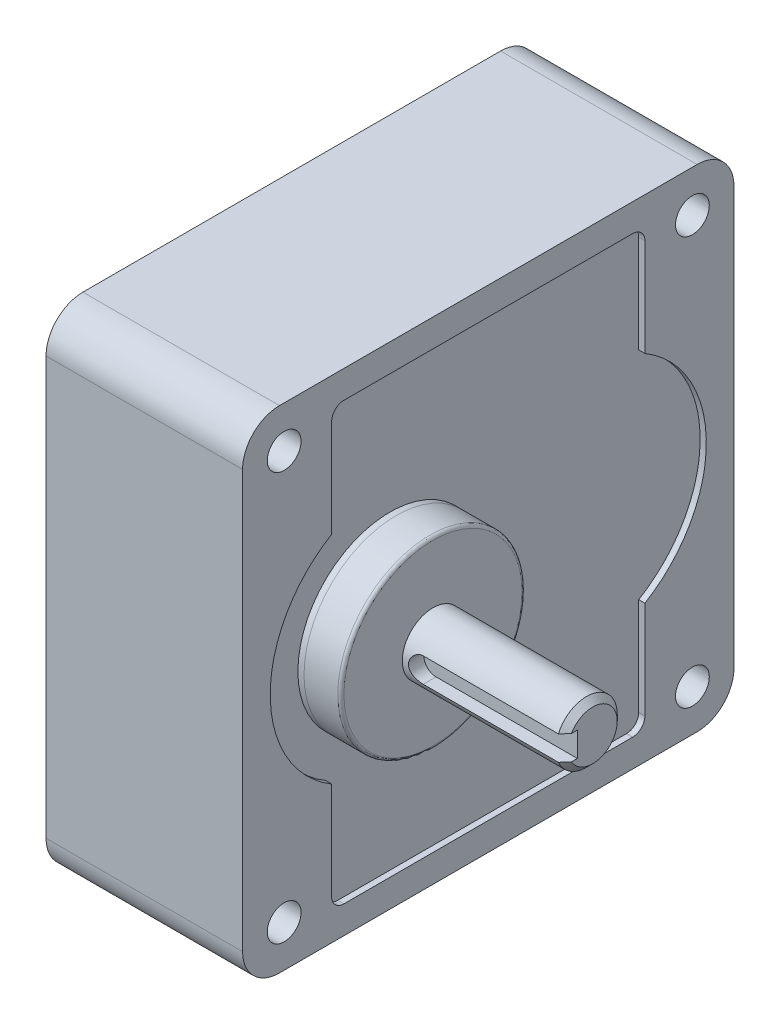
ISO-10303-21;
HEADER;
FILE_DESCRIPTION(('STEP AP214'),'2;1');
FILE_NAME('part.step','',(''),(''),'','','');
FILE_SCHEMA(('AUTOMOTIVE_DESIGN { 1 0 10303 214 1 1 1 1 }'));
ENDSEC;
DATA;
#1=APPLICATION_CONTEXT('core data for automotive mechanical design processes');
#2=APPLICATION_PROTOCOL_DEFINITION('international standard','automotive_design',2000,#1);
#3=PRODUCT_CONTEXT('',#1,'mechanical');
#4=PRODUCT('Part','Part','',(#3));
#5=PRODUCT_RELATED_PRODUCT_CATEGORY('part','',(#4));
#6=PRODUCT_DEFINITION_FORMATION('','',#4);
#7=PRODUCT_DEFINITION_CONTEXT('part definition',#1,'design');
#8=PRODUCT_DEFINITION('design','',#6,#7);
#9=PRODUCT_DEFINITION_SHAPE('','',#8);
#10=(LENGTH_UNIT() NAMED_UNIT(*) SI_UNIT(.MILLI.,.METRE.));
#11=(NAMED_UNIT(*) PLANE_ANGLE_UNIT() SI_UNIT($,.RADIAN.));
#12=(NAMED_UNIT(*) SI_UNIT($,.STERADIAN.) SOLID_ANGLE_UNIT());
#13=UNCERTAINTY_MEASURE_WITH_UNIT(LENGTH_MEASURE(1.E-05),#10,'distance_accuracy_value','');
#14=(GEOMETRIC_REPRESENTATION_CONTEXT(3) GLOBAL_UNCERTAINTY_ASSIGNED_CONTEXT((#13)) GLOBAL_UNIT_ASSIGNED_CONTEXT((#10,
#11,#12)) REPRESENTATION_CONTEXT('',''));
#15=CARTESIAN_POINT('',(0.,0.,0.));
#16=DIRECTION('',(0.,0.,1.));
#17=DIRECTION('',(1.,0.,0.));
#18=AXIS2_PLACEMENT_3D('',#15,#16,#17);
#19=CARTESIAN_POINT('',(64.,0.,17.));
#20=DIRECTION('',(1.,0.,0.));
#21=DIRECTION('',(0.,0.,-1.));
#22=AXIS2_PLACEMENT_3D('',#19,#20,#21);
#23=PLANE('',#22);
#24=DIRECTION('',(0.,0.,1.));
#25=VECTOR('',#24,1.);
#26=CARTESIAN_POINT('',(64.,2.,17.5));
#27=LINE('',#26,#25);
#28=CARTESIAN_POINT('',(63.9999999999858,2.00000000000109,18.4641016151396));
#29=VERTEX_POINT('',#28);
#30=CARTESIAN_POINT('',(64.,2.,17.5));
#31=VERTEX_POINT('',#30);
#32=EDGE_CURVE('E280',#29,#31,#27,.F.);
#33=ORIENTED_EDGE('',*,*,#32,.T.);
#34=DIRECTION('',(0.,1.,0.));
#35=VECTOR('',#34,1.);
#36=CARTESIAN_POINT('',(64.,0.,17.5));
#37=LINE('',#36,#35);
#38=CARTESIAN_POINT('',(64.,-2.,17.5));
#39=VERTEX_POINT('',#38);
#40=EDGE_CURVE('E277',#39,#31,#37,.T.);
#41=ORIENTED_EDGE('',*,*,#40,.F.);
#42=DIRECTION('',(0.,0.,-1.));
#43=VECTOR('',#42,1.);
#44=CARTESIAN_POINT('',(64.,-2.,17.));
#45=LINE('',#44,#43);
#46=CARTESIAN_POINT('',(63.9999999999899,-1.99999999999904,18.4641016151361));
#47=VERTEX_POINT('',#46);
#48=EDGE_CURVE('E265',#39,#47,#45,.F.);
#49=ORIENTED_EDGE('',*,*,#48,.T.);
#50=CARTESIAN_POINT('',(63.9999999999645,0.,15.));
#51=DIRECTION('',(-1.,0.,0.));
#52=DIRECTION('',(0.,0.5,0.866025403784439));
#53=AXIS2_PLACEMENT_3D('',#50,#51,#52);
#54=CIRCLE('',#53,4.00000000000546);
#55=EDGE_CURVE('E288',#29,#47,#54,.T.);
#56=ORIENTED_EDGE('',*,*,#55,.F.);
#57=EDGE_LOOP('',(#33,#41,#49,#56));
#58=FACE_BOUND('',#57,.T.);
#59=ADVANCED_FACE('F16',(#58),#23,.T.);
#60=CARTESIAN_POINT('',(51.9053384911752,0.,17.5));
#61=DIRECTION('',(0.,0.,1.));
#62=DIRECTION('',(1.,0.,0.));
#63=AXIS2_PLACEMENT_3D('',#60,#61,#62);
#64=PLANE('',#63);
#65=CARTESIAN_POINT('',(41.,2.,17.5));
#66=CARTESIAN_POINT('',(40.6185248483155,1.99989883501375,17.5));
#67=CARTESIAN_POINT('',(40.2638105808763,1.85957660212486,17.5));
#68=CARTESIAN_POINT('',(39.8791311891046,1.70740039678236,17.5));
#69=CARTESIAN_POINT('',(39.5857864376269,1.4142135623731,17.5));
#70=CARTESIAN_POINT('',(39.2931870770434,1.12177171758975,17.5));
#71=CARTESIAN_POINT('',(39.1404233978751,0.736189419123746,17.5));
#72=CARTESIAN_POINT('',(39.0001013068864,0.382010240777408,17.5));
#73=CARTESIAN_POINT('',(39.,0.,17.5));
#74=CARTESIAN_POINT('',(38.9998989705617,-0.380964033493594,17.5));
#75=CARTESIAN_POINT('',(39.1404233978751,-0.736189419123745,17.5));
#76=CARTESIAN_POINT('',(39.292599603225,-1.12086881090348,17.5));
#77=CARTESIAN_POINT('',(39.5857864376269,-1.41421356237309,17.5));
#78=CARTESIAN_POINT('',(39.8782282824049,-1.70681292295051,17.5));
#79=CARTESIAN_POINT('',(40.2638105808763,-1.85957660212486,17.5));
#80=CARTESIAN_POINT('',(40.6179897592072,-1.99989869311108,17.5));
#81=CARTESIAN_POINT('',(41.,-2.,17.5));
#82=B_SPLINE_CURVE_WITH_KNOTS('',2,(#65,#66,#67,#68,#69,#70,#71,#72,#73,#74,#75,#76,#77,#78,#79,
#80,#81),.UNSPECIFIED.,.F.,.F.,(3,2,2,2,2,2,2,2,3),(0.,0.125,0.25,0.375,0.5,0.625,0.75,0.875,
1.),.UNSPECIFIED.);
#83=CARTESIAN_POINT('',(41.,2.,17.5));
#84=VERTEX_POINT('',#83);
#85=CARTESIAN_POINT('',(41.,-2.,17.5));
#86=VERTEX_POINT('',#85);
#87=EDGE_CURVE('E286',#84,#86,#82,.T.);
#88=ORIENTED_EDGE('',*,*,#87,.T.);
#89=DIRECTION('',(1.,0.,0.));
#90=VECTOR('',#89,1.);
#91=CARTESIAN_POINT('',(64.,-2.,17.5));
#92=LINE('',#91,#90);
#93=EDGE_CURVE('E272',#86,#39,#92,.T.);
#94=ORIENTED_EDGE('',*,*,#93,.T.);
#95=ORIENTED_EDGE('',*,*,#40,.T.);
#96=DIRECTION('',(1.,0.,0.));
#97=VECTOR('',#96,1.);
#98=CARTESIAN_POINT('',(41.,2.,17.5));
#99=LINE('',#98,#97);
#100=EDGE_CURVE('E305',#31,#84,#99,.F.);
#101=ORIENTED_EDGE('',*,*,#100,.T.);
#102=EDGE_LOOP('',(#88,#94,#95,#101));
#103=FACE_BOUND('',#102,.T.);
#104=ADVANCED_FACE('F284',(#103),#64,.T.);
#105=CARTESIAN_POINT('',(41.,2.,17.5));
#106=DIRECTION('',(0.,1.,0.));
#107=DIRECTION('',(0.,0.,1.));
#108=AXIS2_PLACEMENT_3D('',#105,#106,#107);
#109=PLANE('',#108);
#110=DIRECTION('',(0.,0.,1.));
#111=VECTOR('',#110,1.);
#112=CARTESIAN_POINT('',(41.,2.,17.5));
#113=LINE('',#112,#111);
#114=CARTESIAN_POINT('',(41.,2.,19.5825756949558));
#115=VERTEX_POINT('',#114);
#116=EDGE_CURVE('E290',#115,#84,#113,.F.);
#117=ORIENTED_EDGE('',*,*,#116,.T.);
#118=ORIENTED_EDGE('',*,*,#100,.F.);
#119=ORIENTED_EDGE('',*,*,#32,.F.);
#120=CARTESIAN_POINT('',(62.9999999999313,2.00000000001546,19.5825756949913));
#121=CARTESIAN_POINT('',(63.0465043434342,2.00000086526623,19.5318343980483));
#122=CARTESIAN_POINT('',(63.0929404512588,2.00000911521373,19.4810304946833));
#123=CARTESIAN_POINT('',(63.1844465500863,2.00003141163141,19.3806216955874));
#124=CARTESIAN_POINT('',(63.2295204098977,2.00004530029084,19.3310203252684));
#125=CARTESIAN_POINT('',(63.318302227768,2.00007049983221,19.2330167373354));
#126=CARTESIAN_POINT('',(63.3620142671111,2.00008187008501,19.1846182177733));
#127=CARTESIAN_POINT('',(63.4480721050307,2.000097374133,19.0890193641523));
#128=CARTESIAN_POINT('',(63.490422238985,2.00010169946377,19.0418229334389));
#129=CARTESIAN_POINT('',(63.5737560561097,2.00010149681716,18.9486266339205));
#130=CARTESIAN_POINT('',(63.6147443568,2.00009721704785,18.9026308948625));
#131=CARTESIAN_POINT('',(63.6953541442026,2.00008148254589,18.8118333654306));
#132=CARTESIAN_POINT('',(63.7349805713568,2.00007024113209,18.767035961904));
#133=CARTESIAN_POINT('',(63.8128665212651,2.00004501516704,18.6786317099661));
#134=CARTESIAN_POINT('',(63.8511313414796,2.0000311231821,18.6350295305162));
#135=CARTESIAN_POINT('',(63.9262928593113,2.00000939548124,18.5490103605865));
#136=CARTESIAN_POINT('',(63.9631952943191,2.00000138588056,18.50659838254));
#137=CARTESIAN_POINT('',(63.9999999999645,2.00000000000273,18.4641016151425));
#138=B_SPLINE_CURVE_WITH_KNOTS('',3,(#120,#121,#122,#123,#124,#125,#126,#127,#128,#129,#130,
#131,#132,#133,#134,#135,#136,#137),.UNSPECIFIED.,.F.,.F.,(4,2,2,2,2,2,2,2,4),(0.,
0.206484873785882,0.407550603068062,0.603199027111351,0.793433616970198,0.978259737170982,
1.15768493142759,1.33171923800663,1.50037554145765),.UNSPECIFIED.);
#139=CARTESIAN_POINT('',(62.9999999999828,2.00000000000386,19.5825756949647));
#140=VERTEX_POINT('',#139);
#141=EDGE_CURVE('E291',#140,#29,#138,.T.);
#142=ORIENTED_EDGE('',*,*,#141,.F.);
#143=DIRECTION('',(-1.,0.,0.));
#144=VECTOR('',#143,1.);
#145=CARTESIAN_POINT('',(50.5,2.,19.5825756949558));
#146=LINE('',#145,#144);
#147=EDGE_CURVE('E349',#115,#140,#146,.F.);
#148=ORIENTED_EDGE('',*,*,#147,.F.);
#149=EDGE_LOOP('',(#117,#118,#119,#142,#148));
#150=FACE_BOUND('',#149,.T.);
#151=ADVANCED_FACE('F1530',(#150),#109,.F.);
#152=CARTESIAN_POINT('',(62.9999999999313,0.,15.));
#153=DIRECTION('',(-1.,0.,0.));
#154=DIRECTION('',(0.,0.,1.));
#155=AXIS2_PLACEMENT_3D('',#152,#153,#154);
#156=CONICAL_SURFACE('',#155,5.00000000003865,0.785398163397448);
#157=ORIENTED_EDGE('',*,*,#141,.T.);
#158=ORIENTED_EDGE('',*,*,#55,.T.);
#159=CARTESIAN_POINT('',(63.999999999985,-1.9999999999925,18.4641016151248));
#160=CARTESIAN_POINT('',(63.963194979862,-2.00000135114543,18.5065987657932));
#161=CARTESIAN_POINT('',(63.9262922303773,-2.00000931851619,18.5490111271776));
#162=CARTESIAN_POINT('',(63.8511301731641,-2.00003095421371,18.6350309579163));
#163=CARTESIAN_POINT('',(63.8128651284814,-2.00004479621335,18.6786334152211));
#164=CARTESIAN_POINT('',(63.7349788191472,-2.00006992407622,18.7670381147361));
#165=CARTESIAN_POINT('',(63.6953522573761,-2.00008111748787,18.8118356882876));
#166=CARTESIAN_POINT('',(63.6147422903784,-2.00009676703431,18.902633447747));
#167=CARTESIAN_POINT('',(63.5737539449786,-2.0001010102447,18.9486292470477));
#168=CARTESIAN_POINT('',(63.490420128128,-2.00010116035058,19.0418255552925));
#169=CARTESIAN_POINT('',(63.4480700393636,-2.00009681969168,19.0890219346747));
#170=CARTESIAN_POINT('',(63.3620123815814,-2.00008131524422,19.184620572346));
#171=CARTESIAN_POINT('',(63.3183004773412,-2.00006996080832,19.2330189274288));
#172=CARTESIAN_POINT('',(63.2295190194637,-2.00004483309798,19.3310220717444));
#173=CARTESIAN_POINT('',(63.1844453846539,-2.00003100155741,19.380623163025));
#174=CARTESIAN_POINT('',(63.0929398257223,-2.00000886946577,19.4810312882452));
#175=CARTESIAN_POINT('',(63.046504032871,-2.0000007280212,19.5318347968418));
#176=CARTESIAN_POINT('',(62.999999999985,-1.999999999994,19.5825756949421));
#177=B_SPLINE_CURVE_WITH_KNOTS('',3,(#159,#160,#161,#162,#163,#164,#165,#166,#167,#168,#169,
#170,#171,#172,#173,#174,#175,#176),.UNSPECIFIED.,.F.,.F.,(4,2,2,2,2,2,2,2,4),(0.,
0.168657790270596,0.342693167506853,0.52211901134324,0.70694535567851,0.897179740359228,
1.09282752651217,1.29389218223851,1.50037554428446),.UNSPECIFIED.);
#178=CARTESIAN_POINT('',(62.9999999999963,-1.9999999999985,19.5825756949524));
#179=VERTEX_POINT('',#178);
#180=EDGE_CURVE('E275',#47,#179,#177,.T.);
#181=ORIENTED_EDGE('',*,*,#180,.T.);
#182=CARTESIAN_POINT('',(63.,0.,15.));
#183=DIRECTION('',(-1.,0.,0.));
#184=DIRECTION('',(0.,0.,1.));
#185=AXIS2_PLACEMENT_3D('',#182,#183,#184);
#186=CIRCLE('',#185,5.);
#187=EDGE_CURVE('E344',#140,#179,#186,.T.);
#188=ORIENTED_EDGE('',*,*,#187,.F.);
#189=EDGE_LOOP('',(#157,#158,#181,#188));
#190=FACE_BOUND('',#189,.T.);
#191=ADVANCED_FACE('F1539',(#190),#156,.T.);
#192=CARTESIAN_POINT('',(64.,-2.,17.5));
#193=DIRECTION('',(0.,-1.,0.));
#194=DIRECTION('',(0.,0.,-1.));
#195=AXIS2_PLACEMENT_3D('',#192,#193,#194);
#196=PLANE('',#195);
#197=ORIENTED_EDGE('',*,*,#180,.F.);
#198=ORIENTED_EDGE('',*,*,#48,.F.);
#199=ORIENTED_EDGE('',*,*,#93,.F.);
#200=DIRECTION('',(0.,0.,1.));
#201=VECTOR('',#200,1.);
#202=CARTESIAN_POINT('',(41.,-2.,17.5));
#203=LINE('',#202,#201);
#204=CARTESIAN_POINT('',(41.,-2.,19.5825756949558));
#205=VERTEX_POINT('',#204);
#206=EDGE_CURVE('E330',#86,#205,#203,.T.);
#207=ORIENTED_EDGE('',*,*,#206,.T.);
#208=DIRECTION('',(-1.,0.,0.));
#209=VECTOR('',#208,1.);
#210=CARTESIAN_POINT('',(50.5,-2.,19.5825756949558));
#211=LINE('',#210,#209);
#212=EDGE_CURVE('E340',#179,#205,#211,.T.);
#213=ORIENTED_EDGE('',*,*,#212,.F.);
#214=EDGE_LOOP('',(#197,#198,#199,#207,#213));
#215=FACE_BOUND('',#214,.T.);
#216=ADVANCED_FACE('F270',(#215),#196,.F.);
#217=CARTESIAN_POINT('',(41.,0.,17.5));
#218=DIRECTION('',(0.,0.,1.));
#219=DIRECTION('',(1.,0.,0.));
#220=AXIS2_PLACEMENT_3D('',#217,#218,#219);
#221=CYLINDRICAL_SURFACE('',#220,2.);
#222=ORIENTED_EDGE('',*,*,#206,.F.);
#223=ORIENTED_EDGE('',*,*,#87,.F.);
#224=ORIENTED_EDGE('',*,*,#116,.F.);
#225=CARTESIAN_POINT('',(39.,0.,20.));
#226=CARTESIAN_POINT('',(38.9999973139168,0.0331170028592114,20.0000012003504));
#227=CARTESIAN_POINT('',(39.000796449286,0.0662351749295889,19.9996710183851));
#228=CARTESIAN_POINT('',(39.0040080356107,0.132198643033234,19.9983599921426));
#229=CARTESIAN_POINT('',(39.0064116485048,0.165044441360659,19.9973827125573));
#230=CARTESIAN_POINT('',(39.0128315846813,0.230451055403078,19.9947933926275));
#231=CARTESIAN_POINT('',(39.0168429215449,0.263012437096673,19.9931833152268));
#232=CARTESIAN_POINT('',(39.0264735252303,0.327838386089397,19.9893461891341));
#233=CARTESIAN_POINT('',(39.0320917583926,0.360103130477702,19.9871195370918));
#234=CARTESIAN_POINT('',(39.0449323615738,0.424325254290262,19.9820665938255));
#235=CARTESIAN_POINT('',(39.0521576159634,0.456281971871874,19.9792392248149));
#236=CARTESIAN_POINT('',(39.0682083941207,0.519878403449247,19.9730022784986));
#237=CARTESIAN_POINT('',(39.0770405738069,0.551516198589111,19.9695902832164));
#238=CARTESIAN_POINT('',(39.0963010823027,0.614466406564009,19.9622013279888));
#239=CARTESIAN_POINT('',(39.1067395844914,0.645775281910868,19.9582207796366));
#240=CARTESIAN_POINT('',(39.1292108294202,0.708059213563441,19.9497120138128));
#241=CARTESIAN_POINT('',(39.1412569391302,0.739028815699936,19.9451792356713));
#242=CARTESIAN_POINT('',(39.1666812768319,0.800022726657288,19.9356770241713));
#243=CARTESIAN_POINT('',(39.1800469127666,0.830052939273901,19.9307117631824));
#244=CARTESIAN_POINT('',(39.2081146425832,0.889212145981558,19.9203860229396));
#245=CARTESIAN_POINT('',(39.2228092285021,0.918345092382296,19.9150277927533));
#246=CARTESIAN_POINT('',(39.253533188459,0.975708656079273,19.9039619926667));
#247=CARTESIAN_POINT('',(39.2695582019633,1.00394183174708,19.8982555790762));
#248=CARTESIAN_POINT('',(39.302939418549,1.05950753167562,19.8865375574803));
#249=CARTESIAN_POINT('',(39.3202943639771,1.08684087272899,19.8805262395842));
#250=CARTESIAN_POINT('',(39.3563324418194,1.14060978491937,19.8682410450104));
#251=CARTESIAN_POINT('',(39.3750172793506,1.16704413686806,19.8619668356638));
#252=CARTESIAN_POINT('',(39.4137121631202,1.21901935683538,19.8491968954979));
#253=CARTESIAN_POINT('',(39.4337266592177,1.24455673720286,19.8427004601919));
#254=CARTESIAN_POINT('',(39.4750781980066,1.29474353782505,19.8295254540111));
#255=CARTESIAN_POINT('',(39.4964221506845,1.3193870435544,19.8228460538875));
#256=CARTESIAN_POINT('',(39.5404301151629,1.36779231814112,19.8093430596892));
#257=CARTESIAN_POINT('',(39.5631031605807,1.39154566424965,19.8025187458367));
#258=CARTESIAN_POINT('',(39.6097269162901,1.43813812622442,19.7887736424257));
#259=CARTESIAN_POINT('',(39.6336864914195,1.46096827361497,19.7818525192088));
#260=CARTESIAN_POINT('',(39.6824493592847,1.50520706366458,19.7681110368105));
#261=CARTESIAN_POINT('',(39.7072415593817,1.52662782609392,19.7612903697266));
#262=CARTESIAN_POINT('',(39.7576669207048,1.56806246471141,19.7478048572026));
#263=CARTESIAN_POINT('',(39.7832916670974,1.58808631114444,19.7411391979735));
#264=CARTESIAN_POINT('',(39.8353793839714,1.62674272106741,19.7280146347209));
#265=CARTESIAN_POINT('',(39.8618365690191,1.64538274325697,19.721554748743));
#266=CARTESIAN_POINT('',(39.9155865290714,1.68128740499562,19.7088888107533));
#267=CARTESIAN_POINT('',(39.9428760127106,1.69855668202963,19.7026819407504));
#268=CARTESIAN_POINT('',(39.9982879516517,1.73173619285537,19.6905651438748));
#269=CARTESIAN_POINT('',(40.0264093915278,1.74764799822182,19.6846548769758));
#270=CARTESIAN_POINT('',(40.0834834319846,1.77812795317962,19.6731709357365));
#271=CARTESIAN_POINT('',(40.1124370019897,1.79269444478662,19.6675976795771));
#272=CARTESIAN_POINT('',(40.1711717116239,1.82050211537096,19.6568224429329));
#273=CARTESIAN_POINT('',(40.2009554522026,1.83373834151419,19.6516218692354));
#274=CARTESIAN_POINT('',(40.2617966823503,1.85907484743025,19.6415547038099));
#275=CARTESIAN_POINT('',(40.2928677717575,1.87114612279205,19.6366971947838));
#276=CARTESIAN_POINT('',(40.3552987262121,1.8936317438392,19.6275592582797));
#277=CARTESIAN_POINT('',(40.3866517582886,1.90406270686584,19.6232731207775));
#278=CARTESIAN_POINT('',(40.4496426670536,1.92328664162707,19.6153088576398));
#279=CARTESIAN_POINT('',(40.4812759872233,1.93209254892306,19.61162595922));
#280=CARTESIAN_POINT('',(40.5448255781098,1.94808062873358,19.6048948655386));
#281=CARTESIAN_POINT('',(40.5767392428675,1.95527168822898,19.6018432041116));
#282=CARTESIAN_POINT('',(40.6408474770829,1.96804371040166,19.596395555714));
#283=CARTESIAN_POINT('',(40.6730409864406,1.97362920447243,19.5939977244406));
#284=CARTESIAN_POINT('',(40.737707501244,1.98320210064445,19.5898732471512));
#285=CARTESIAN_POINT('',(40.7701805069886,1.98718950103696,19.5881466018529));
#286=CARTESIAN_POINT('',(40.8354048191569,1.99357529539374,19.5853757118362));
#287=CARTESIAN_POINT('',(40.8681566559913,1.99596911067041,19.584333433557));
#288=CARTESIAN_POINT('',(40.9339389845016,1.9991787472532,19.5829340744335));
#289=CARTESIAN_POINT('',(40.9669700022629,1.99998552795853,19.5825809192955));
#290=CARTESIAN_POINT('',(41.,2.,19.5825756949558));
#291=B_SPLINE_CURVE_WITH_KNOTS('',3,(#225,#226,#227,#228,#229,#230,#231,#232,#233,#234,#235,
#236,#237,#238,#239,#240,#241,#242,#243,#244,#245,#246,#247,#248,#249,#250,#251,#252,#253,#254,
#255,#256,#257,#258,#259,#260,#261,#262,#263,#264,#265,#266,#267,#268,#269,#270,#271,#272,#273,
#274,#275,#276,#277,#278,#279,#280,#281,#282,#283,#284,#285,#286,#287,#288,#289,#290),
.UNSPECIFIED.,.F.,.F.,(4,2,2,2,2,2,2,2,2,2,2,2,2,2,2,2,2,2,2,2,2,2,2,2,2,2,2,2,2,2,2,2,4),(0.,
0.0993413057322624,0.198139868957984,0.29663434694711,0.395065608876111,0.493674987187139,
0.592702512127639,0.692385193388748,0.792955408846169,0.892644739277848,0.991802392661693,
1.09064699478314,1.18939925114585,1.28828048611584,1.38751116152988,1.48730942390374,
1.58788972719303,1.68928509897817,1.78964669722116,1.88919727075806,1.98816504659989,
2.08678229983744,2.18528378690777,2.28390509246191,2.38288094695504,2.48389493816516,
2.58380852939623,2.68288882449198,2.78140970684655,2.87964974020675,2.97788987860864,
3.07641107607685,3.17549189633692),.UNSPECIFIED.);
#292=CARTESIAN_POINT('',(39.,0.,20.));
#293=VERTEX_POINT('',#292);
#294=EDGE_CURVE('E337',#293,#115,#291,.T.);
#295=ORIENTED_EDGE('',*,*,#294,.F.);
#296=CARTESIAN_POINT('',(41.,-2.,19.5825756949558));
#297=CARTESIAN_POINT('',(40.9669786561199,-1.99998609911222,19.5825806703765));
#298=CARTESIAN_POINT('',(40.9339562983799,-1.99917975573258,19.5829336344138));
#299=CARTESIAN_POINT('',(40.8681888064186,-1.99597097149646,19.5843326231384));
#300=CARTESIAN_POINT('',(40.8354431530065,-1.9935774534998,19.5853747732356));
#301=CARTESIAN_POINT('',(40.7702287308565,-1.98719223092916,19.5881454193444));
#302=CARTESIAN_POINT('',(40.737759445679,-1.98320498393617,19.5898720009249));
#303=CARTESIAN_POINT('',(40.6730978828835,-1.97363237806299,19.5939963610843));
#304=CARTESIAN_POINT('',(40.640905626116,-1.96804689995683,19.5963941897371));
#305=CARTESIAN_POINT('',(40.57679740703,-1.95527487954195,19.6018418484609));
#306=CARTESIAN_POINT('',(40.5448825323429,-1.94808368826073,19.6048935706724));
#307=CARTESIAN_POINT('',(40.4813280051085,-1.93209535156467,19.6116247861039));
#308=CARTESIAN_POINT('',(40.4496909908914,-1.92328920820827,19.6153077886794));
#309=CARTESIAN_POINT('',(40.3866902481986,-1.90406463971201,19.6232723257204));
#310=CARTESIAN_POINT('',(40.3553311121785,-1.89363317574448,19.6275586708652));
#311=CARTESIAN_POINT('',(40.2928852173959,-1.87114698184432,19.6366968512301));
#312=CARTESIAN_POINT('',(40.2618053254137,-1.85907554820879,19.6415544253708));
#313=CARTESIAN_POINT('',(40.2009677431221,-1.83374629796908,19.6516187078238));
#314=CARTESIAN_POINT('',(40.1711959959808,-1.82051846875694,19.6568160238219));
#315=CARTESIAN_POINT('',(40.1124819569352,-1.79272502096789,19.6675859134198));
#316=CARTESIAN_POINT('',(40.0835371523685,-1.77816418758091,19.6731571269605));
#317=CARTESIAN_POINT('',(40.0264770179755,-1.74769355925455,19.684637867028));
#318=CARTESIAN_POINT('',(39.998360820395,-1.73178524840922,19.6905470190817));
#319=CARTESIAN_POINT('',(39.9429558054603,-1.69861055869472,19.7026624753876));
#320=CARTESIAN_POINT('',(39.915668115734,-1.68134243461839,19.7088691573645));
#321=CARTESIAN_POINT('',(39.8619181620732,-1.64543791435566,19.7215355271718));
#322=CARTESIAN_POINT('',(39.835459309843,-1.62679671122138,19.7279960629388));
#323=CARTESIAN_POINT('',(39.7833646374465,-1.58813576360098,19.7411226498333));
#324=CARTESIAN_POINT('',(39.7577347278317,-1.56810839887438,19.7477897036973));
#325=CARTESIAN_POINT('',(39.7072955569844,-1.52666437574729,19.7612786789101));
#326=CARTESIAN_POINT('',(39.6824948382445,-1.50523759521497,19.7681014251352));
#327=CARTESIAN_POINT('',(39.6337109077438,-1.46098488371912,19.7818474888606));
#328=CARTESIAN_POINT('',(39.6097389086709,-1.43814669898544,19.7887711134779));
#329=CARTESIAN_POINT('',(39.5631115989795,-1.3915574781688,19.8025152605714));
#330=CARTESIAN_POINT('',(39.5404464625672,-1.36781638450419,19.8093361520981));
#331=CARTESIAN_POINT('',(39.4964522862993,-1.31943200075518,19.8228337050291));
#332=CARTESIAN_POINT('',(39.4751143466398,-1.29479700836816,19.8295110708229));
#333=CARTESIAN_POINT('',(39.4337722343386,-1.24462408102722,19.8426831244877));
#334=CARTESIAN_POINT('',(39.4137613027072,-1.21909193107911,19.849178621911));
#335=CARTESIAN_POINT('',(39.3750710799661,-1.1671238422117,19.8619476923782));
#336=CARTESIAN_POINT('',(39.3563875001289,-1.14069126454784,19.8682219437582));
#337=CARTESIAN_POINT('',(39.3203494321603,-1.08692255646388,19.8805080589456));
#338=CARTESIAN_POINT('',(39.3029934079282,-1.05958752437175,19.8865202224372));
#339=CARTESIAN_POINT('',(39.2696074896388,-1.00401506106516,19.8982406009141));
#340=CARTESIAN_POINT('',(39.2535790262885,-0.975776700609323,19.9039484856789));
#341=CARTESIAN_POINT('',(39.2228457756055,-0.918399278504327,19.9150177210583));
#342=CARTESIAN_POINT('',(39.2081455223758,-0.889257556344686,19.9203778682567));
#343=CARTESIAN_POINT('',(39.1800634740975,-0.83007751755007,19.930707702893));
#344=CARTESIAN_POINT('',(39.1666893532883,-0.80003515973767,19.9356750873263));
#345=CARTESIAN_POINT('',(39.1412571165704,-0.739036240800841,19.9451780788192));
#346=CARTESIAN_POINT('',(39.1292106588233,-0.708074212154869,19.9497098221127));
#347=CARTESIAN_POINT('',(39.1067391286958,-0.645803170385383,19.9582171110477));
#348=CARTESIAN_POINT('',(39.0963007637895,-0.614499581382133,19.9621971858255));
#349=CARTESIAN_POINT('',(39.0770403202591,-0.551557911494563,19.9695856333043));
#350=CARTESIAN_POINT('',(39.0682081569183,-0.519923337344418,19.9729975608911));
#351=CARTESIAN_POINT('',(39.0521573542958,-0.456331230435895,19.9792347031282));
#352=CARTESIAN_POINT('',(39.0449321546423,-0.424375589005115,19.9820622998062));
#353=CARTESIAN_POINT('',(39.0320915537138,-0.360153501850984,19.9871159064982));
#354=CARTESIAN_POINT('',(39.0264733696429,-0.327887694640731,19.9893429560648));
#355=CARTESIAN_POINT('',(39.0168427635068,-0.263057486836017,19.99318096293));
#356=CARTESIAN_POINT('',(39.0128314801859,-0.23049289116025,19.9947914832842));
#357=CARTESIAN_POINT('',(39.0064115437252,-0.165077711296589,19.9973816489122));
#358=CARTESIAN_POINT('',(39.0040079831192,-0.132226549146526,19.9983592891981));
#359=CARTESIAN_POINT('',(39.0007963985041,-0.0662502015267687,19.9996708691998));
#360=CARTESIAN_POINT('',(38.9999973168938,-0.0331245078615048,20.0000012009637));
#361=CARTESIAN_POINT('',(39.,0.,20.));
#362=B_SPLINE_CURVE_WITH_KNOTS('',3,(#296,#297,#298,#299,#300,#301,#302,#303,#304,#305,#306,
#307,#308,#309,#310,#311,#312,#313,#314,#315,#316,#317,#318,#319,#320,#321,#322,#323,#324,#325,
#326,#327,#328,#329,#330,#331,#332,#333,#334,#335,#336,#337,#338,#339,#340,#341,#342,#343,#344,
#345,#346,#347,#348,#349,#350,#351,#352,#353,#354,#355,#356,#357,#358,#359,#360,#361),
.UNSPECIFIED.,.F.,.F.,(4,2,2,2,2,2,2,2,2,2,2,2,2,2,2,2,2,2,2,2,2,2,2,2,2,2,2,2,2,2,2,2,4),(0.,
0.0990548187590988,0.197557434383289,0.295786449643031,0.394022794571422,0.492547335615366,
0.591638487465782,0.691569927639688,0.792608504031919,0.891540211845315,0.990129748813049,
1.08861207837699,1.18722292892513,1.2861971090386,1.38576685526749,1.48616026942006,
1.58759989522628,1.6881360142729,1.78790251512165,1.8871140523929,1.98598889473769,
2.0847475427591,2.18361127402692,2.2828006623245,2.38253412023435,2.48308329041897,
2.58275067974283,2.68176889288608,2.78037512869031,2.87880956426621,2.97731363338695,
3.07612825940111,3.17549210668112),.UNSPECIFIED.);
#363=EDGE_CURVE('E343',#205,#293,#362,.T.);
#364=ORIENTED_EDGE('',*,*,#363,.F.);
#365=EDGE_LOOP('',(#222,#223,#224,#295,#364));
#366=FACE_BOUND('',#365,.T.);
#367=ADVANCED_FACE('F307',(#366),#221,.F.);
#368=CARTESIAN_POINT('',(63.,0.,15.));
#369=DIRECTION('',(-1.,0.,0.));
#370=DIRECTION('',(0.,0.,1.));
#371=AXIS2_PLACEMENT_3D('',#368,#369,#370);
#372=CYLINDRICAL_SURFACE('',#371,5.);
#373=CARTESIAN_POINT('',(38.,0.,20.));
#374=CARTESIAN_POINT('',(38.,0.953705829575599,19.9998988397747));
#375=CARTESIAN_POINT('',(38.,1.84047354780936,19.6489415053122));
#376=CARTESIAN_POINT('',(38.,2.3113107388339,19.4625975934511));
#377=CARTESIAN_POINT('',(38.,2.73604876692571,19.1849775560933));
#378=CARTESIAN_POINT('',(38.,3.16899919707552,18.9019896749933));
#379=CARTESIAN_POINT('',(38.,3.53553390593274,18.5355339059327));
#380=CARTESIAN_POINT('',(38.,3.90131109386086,18.1698354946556));
#381=CARTESIAN_POINT('',(38.,4.18497755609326,17.7360487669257));
#382=CARTESIAN_POINT('',(38.,4.46211402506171,17.3122477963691));
#383=CARTESIAN_POINT('',(38.,4.64894150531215,16.8404735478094));
#384=CARTESIAN_POINT('',(38.,4.99989878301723,15.9542409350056));
#385=CARTESIAN_POINT('',(38.,5.,15.));
#386=CARTESIAN_POINT('',(38.,5.00010110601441,14.0468052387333));
#387=CARTESIAN_POINT('',(38.,4.64894150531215,13.1595264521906));
#388=CARTESIAN_POINT('',(38.,4.46259759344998,12.688689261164));
#389=CARTESIAN_POINT('',(38.,4.18497755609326,12.2639512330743));
#390=CARTESIAN_POINT('',(38.,3.90198967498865,11.8310008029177));
#391=CARTESIAN_POINT('',(38.,3.53553390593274,11.4644660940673));
#392=CARTESIAN_POINT('',(38.,3.16983549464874,11.0986889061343));
#393=CARTESIAN_POINT('',(38.,2.73604876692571,10.8150224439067));
#394=CARTESIAN_POINT('',(38.,2.31224779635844,10.5378859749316));
#395=CARTESIAN_POINT('',(38.,1.84047354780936,10.3510584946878));
#396=CARTESIAN_POINT('',(38.,0.954240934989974,10.0001012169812));
#397=CARTESIAN_POINT('',(38.,0.,10.));
#398=B_SPLINE_CURVE_WITH_KNOTS('',2,(#373,#374,#375,#376,#377,#378,#379,#380,#381,#382,#383,
#384,#385,#386,#387,#388,#389,#390,#391,#392,#393,#394,#395,#396,#397),.UNSPECIFIED.,.F.,.F.,(3,
2,2,2,2,2,2,2,2,2,2,2,3),(0.,0.125,0.1875,0.25,0.3125,0.375,0.5,0.625,0.6875,0.75,0.8125,0.875,
1.),.UNSPECIFIED.);
#399=CARTESIAN_POINT('',(38.,0.,20.));
#400=VERTEX_POINT('',#399);
#401=CARTESIAN_POINT('',(38.,0.,10.));
#402=VERTEX_POINT('',#401);
#403=EDGE_CURVE('E364',#400,#402,#398,.T.);
#404=ORIENTED_EDGE('',*,*,#403,.F.);
#405=CARTESIAN_POINT('',(38.,0.,10.));
#406=CARTESIAN_POINT('',(38.,-0.953705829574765,10.0001011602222));
#407=CARTESIAN_POINT('',(38.,-1.84047354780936,10.3510584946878));
#408=CARTESIAN_POINT('',(38.,-2.31131073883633,10.5374024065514));
#409=CARTESIAN_POINT('',(38.,-2.73604876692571,10.8150224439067));
#410=CARTESIAN_POINT('',(38.,-3.16899919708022,11.0980103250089));
#411=CARTESIAN_POINT('',(38.,-3.53553390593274,11.4644660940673));
#412=CARTESIAN_POINT('',(38.,-3.9013110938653,11.8301645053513));
#413=CARTESIAN_POINT('',(38.,-4.18497755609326,12.2639512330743));
#414=CARTESIAN_POINT('',(38.,-4.46211402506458,12.6877522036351));
#415=CARTESIAN_POINT('',(38.,-4.64894150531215,13.1595264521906));
#416=CARTESIAN_POINT('',(38.,-4.99989878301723,14.045759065));
#417=CARTESIAN_POINT('',(38.,-5.,15.));
#418=CARTESIAN_POINT('',(38.,-5.00010110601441,15.9531947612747));
#419=CARTESIAN_POINT('',(38.,-4.64894150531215,16.8404735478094));
#420=CARTESIAN_POINT('',(38.,-4.46259759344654,17.3113107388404));
#421=CARTESIAN_POINT('',(38.,-4.18497755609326,17.7360487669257));
#422=CARTESIAN_POINT('',(38.,-3.90198967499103,18.1689991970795));
#423=CARTESIAN_POINT('',(38.,-3.53553390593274,18.5355339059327));
#424=CARTESIAN_POINT('',(38.,-3.16983549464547,18.9013110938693));
#425=CARTESIAN_POINT('',(38.,-2.73604876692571,19.1849775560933));
#426=CARTESIAN_POINT('',(38.,-2.31224779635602,19.4621140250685));
#427=CARTESIAN_POINT('',(38.,-1.84047354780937,19.6489415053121));
#428=CARTESIAN_POINT('',(38.,-0.9542409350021,19.9998987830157));
#429=CARTESIAN_POINT('',(38.,0.,20.));
#430=B_SPLINE_CURVE_WITH_KNOTS('',2,(#405,#406,#407,#408,#409,#410,#411,#412,#413,#414,#415,
#416,#417,#418,#419,#420,#421,#422,#423,#424,#425,#426,#427,#428,#429),.UNSPECIFIED.,.F.,.F.,(3,
2,2,2,2,2,2,2,2,2,2,2,3),(0.,0.125,0.1875,0.25,0.3125,0.375,0.5,0.625,0.6875,0.75,0.8125,0.875,
1.),.UNSPECIFIED.);
#431=EDGE_CURVE('E384',#402,#400,#430,.T.);
#432=ORIENTED_EDGE('',*,*,#431,.F.);
#433=EDGE_LOOP('',(#404,#432));
#434=FACE_BOUND('',#433,.T.);
#435=ORIENTED_EDGE('',*,*,#212,.T.);
#436=ORIENTED_EDGE('',*,*,#363,.T.);
#437=ORIENTED_EDGE('',*,*,#294,.T.);
#438=ORIENTED_EDGE('',*,*,#147,.T.);
#439=ORIENTED_EDGE('',*,*,#187,.T.);
#440=EDGE_LOOP('',(#435,#436,#437,#438,#439));
#441=FACE_BOUND('',#440,.T.);
#442=ADVANCED_FACE('F316',(#434,#441),#372,.T.);
#443=CARTESIAN_POINT('',(38.,0.,24.75));
#444=DIRECTION('',(1.,0.,0.));
#445=DIRECTION('',(0.,0.,-1.));
#446=AXIS2_PLACEMENT_3D('',#443,#444,#445);
#447=PLANE('',#446);
#448=ORIENTED_EDGE('',*,*,#403,.T.);
#449=ORIENTED_EDGE('',*,*,#431,.T.);
#450=EDGE_LOOP('',(#448,#449));
#451=FACE_BOUND('',#450,.T.);
#452=CARTESIAN_POINT('',(38.,0.,15.));
#453=DIRECTION('',(-1.,0.,0.));
#454=DIRECTION('',(0.,0.,1.));
#455=AXIS2_PLACEMENT_3D('',#452,#453,#454);
#456=CIRCLE('',#455,14.5);
#457=CARTESIAN_POINT('',(38.,0.,29.5));
#458=VERTEX_POINT('',#457);
#459=EDGE_CURVE('E1487',#458,#458,#456,.T.);
#460=ORIENTED_EDGE('',*,*,#459,.F.);
#461=EDGE_LOOP('',(#460));
#462=FACE_BOUND('',#461,.T.);
#463=ADVANCED_FACE('F403',(#451,#462),#447,.T.);
#464=CARTESIAN_POINT('',(37.5,0.,15.));
#465=DIRECTION('',(-1.,0.,0.));
#466=DIRECTION('',(0.,0.,1.));
#467=AXIS2_PLACEMENT_3D('',#464,#465,#466);
#468=TOROIDAL_SURFACE('',#467,14.5,0.5);
#469=ORIENTED_EDGE('',*,*,#459,.T.);
#470=EDGE_LOOP('',(#469));
#471=FACE_BOUND('',#470,.T.);
#472=CARTESIAN_POINT('',(37.5,0.,15.));
#473=DIRECTION('',(-1.,0.,0.));
#474=DIRECTION('',(0.,0.,1.));
#475=AXIS2_PLACEMENT_3D('',#472,#473,#474);
#476=CIRCLE('',#475,15.);
#477=CARTESIAN_POINT('',(37.5,0.,30.));
#478=VERTEX_POINT('',#477);
#479=EDGE_CURVE('E1479',#478,#478,#476,.T.);
#480=ORIENTED_EDGE('',*,*,#479,.F.);
#481=EDGE_LOOP('',(#480));
#482=FACE_BOUND('',#481,.T.);
#483=ADVANCED_FACE('F392',(#471,#482),#468,.T.);
#484=CARTESIAN_POINT('',(37.5,0.,15.));
#485=DIRECTION('',(-1.,0.,0.));
#486=DIRECTION('',(0.,0.,1.));
#487=AXIS2_PLACEMENT_3D('',#484,#485,#486);
#488=CYLINDRICAL_SURFACE('',#487,15.);
#489=ORIENTED_EDGE('',*,*,#479,.T.);
#490=EDGE_LOOP('',(#489));
#491=FACE_BOUND('',#490,.T.);
#492=CARTESIAN_POINT('',(32.,0.,15.));
#493=DIRECTION('',(-1.,0.,0.));
#494=DIRECTION('',(0.,0.,1.));
#495=AXIS2_PLACEMENT_3D('',#492,#493,#494);
#496=CIRCLE('',#495,14.9999);
#497=CARTESIAN_POINT('',(32.,0.,29.99995));
#498=VERTEX_POINT('',#497);
#499=CARTESIAN_POINT('',(32.,0.,5.00000000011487E-05));
#500=VERTEX_POINT('',#499);
#501=EDGE_CURVE('E1466',#498,#500,#496,.T.);
#502=ORIENTED_EDGE('',*,*,#501,.F.);
#503=CARTESIAN_POINT('',(32.,0.,15.));
#504=DIRECTION('',(-1.,0.,0.));
#505=DIRECTION('',(0.,0.,-1.));
#506=AXIS2_PLACEMENT_3D('',#503,#504,#505);
#507=CIRCLE('',#506,14.9999);
#508=EDGE_CURVE('E1486',#500,#498,#507,.T.);
#509=ORIENTED_EDGE('',*,*,#508,.F.);
#510=EDGE_LOOP('',(#502,#509));
#511=FACE_BOUND('',#510,.T.);
#512=ADVANCED_FACE('F402',(#491,#511),#488,.T.);
#513=CARTESIAN_POINT('',(16.,0.,0.));
#514=DIRECTION('',(1.,0.,0.));
#515=DIRECTION('',(0.,1.,0.));
#516=AXIS2_PLACEMENT_3D('',#513,#514,#515);
#517=PLANE('',#516);
#518=CARTESIAN_POINT('',(16.,0.,-38.));
#519=CARTESIAN_POINT('',(16.,-3.48692966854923,-37.9999513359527));
#520=CARTESIAN_POINT('',(16.,-6.91459599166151,-37.3656039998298));
#521=CARTESIAN_POINT('',(16.,-10.5505323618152,-36.6927127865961));
#522=CARTESIAN_POINT('',(16.,-13.9875989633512,-35.3319554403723));
#523=CARTESIAN_POINT('',(16.,-17.5699911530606,-33.913662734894));
#524=CARTESIAN_POINT('',(16.,-20.7939706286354,-31.8058294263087));
#525=CARTESIAN_POINT('',(16.,-24.0879902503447,-29.6522039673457));
#526=CARTESIAN_POINT('',(16.,-26.8700576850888,-26.8700576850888));
#527=CARTESIAN_POINT('',(16.,-29.6528825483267,-24.0871539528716));
#528=CARTESIAN_POINT('',(16.,-31.8058294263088,-20.7939706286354));
#529=CARTESIAN_POINT('',(16.,-33.9141463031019,-17.5690540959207));
#530=CARTESIAN_POINT('',(16.,-35.3319554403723,-13.9875989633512));
#531=CARTESIAN_POINT('',(16.,-36.6930041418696,-10.5495234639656));
#532=CARTESIAN_POINT('',(16.,-37.3656039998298,-6.9145959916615));
#533=CARTESIAN_POINT('',(16.,-38.0000486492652,-3.48587048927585));
#534=CARTESIAN_POINT('',(16.,-38.,0.));
#535=CARTESIAN_POINT('',(16.,-37.9999513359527,3.48692966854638));
#536=CARTESIAN_POINT('',(16.,-37.3656039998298,6.91459599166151));
#537=CARTESIAN_POINT('',(16.,-36.6927127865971,10.5505323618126));
#538=CARTESIAN_POINT('',(16.,-35.3319554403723,13.9875989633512));
#539=CARTESIAN_POINT('',(16.,-33.9136627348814,17.5699911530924));
#540=CARTESIAN_POINT('',(16.,-31.8058294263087,20.7939706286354));
#541=CARTESIAN_POINT('',(16.,-29.6522039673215,24.0879902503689));
#542=CARTESIAN_POINT('',(16.,-26.8700576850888,26.8700576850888));
#543=CARTESIAN_POINT('',(16.,-24.0871539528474,29.6528825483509));
#544=CARTESIAN_POINT('',(16.,-20.7939706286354,31.8058294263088));
#545=CARTESIAN_POINT('',(16.,-17.5690540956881,33.9141463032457));
#546=CARTESIAN_POINT('',(16.,-13.9875989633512,35.3319554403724));
#547=CARTESIAN_POINT('',(16.,-10.5495234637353,36.6930041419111));
#548=CARTESIAN_POINT('',(16.,-6.9145959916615,37.3656039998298));
#549=CARTESIAN_POINT('',(16.,-3.48639635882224,37.9999513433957));
#550=CARTESIAN_POINT('',(16.,0.,38.));
#551=B_SPLINE_CURVE_WITH_KNOTS('',2,(#518,#519,#520,#521,#522,#523,#524,#525,#526,#527,#528,
#529,#530,#531,#532,#533,#534,#535,#536,#537,#538,#539,#540,#541,#542,#543,#544,#545,#546,#547,
#548,#549,#550),.UNSPECIFIED.,.F.,.F.,(3,2,2,2,2,2,2,2,2,2,2,2,2,2,2,2,3),(0.,0.0625,0.125,
0.1875,0.25,0.3125,0.375,0.4375,0.5,0.5625,0.625,0.6875,0.75,0.8125,0.875,0.9375,1.),.UNSPECIFIED.);
#552=CARTESIAN_POINT('',(16.,0.,-38.));
#553=VERTEX_POINT('',#552);
#554=CARTESIAN_POINT('',(16.,0.,38.));
#555=VERTEX_POINT('',#554);
#556=EDGE_CURVE('E417',#553,#555,#551,.T.);
#557=ORIENTED_EDGE('',*,*,#556,.T.);
#558=CARTESIAN_POINT('',(16.,0.,38.));
#559=CARTESIAN_POINT('',(16.,3.48692966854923,37.9999513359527));
#560=CARTESIAN_POINT('',(16.,6.91459599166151,37.3656039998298));
#561=CARTESIAN_POINT('',(16.,10.5505323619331,36.6927127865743));
#562=CARTESIAN_POINT('',(16.,13.9875989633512,35.3319554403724));
#563=CARTESIAN_POINT('',(16.,17.5699911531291,33.913662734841));
#564=CARTESIAN_POINT('',(16.,20.7939706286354,31.8058294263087));
#565=CARTESIAN_POINT('',(16.,24.0879902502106,29.6522039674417));
#566=CARTESIAN_POINT('',(16.,26.8700576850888,26.8700576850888));
#567=CARTESIAN_POINT('',(16.,29.6528825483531,24.0871539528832));
#568=CARTESIAN_POINT('',(16.,31.8058294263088,20.7939706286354));
#569=CARTESIAN_POINT('',(16.,33.9141463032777,17.5690540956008));
#570=CARTESIAN_POINT('',(16.,35.3319554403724,13.9875989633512));
#571=CARTESIAN_POINT('',(16.,36.6930041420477,10.5495234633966));
#572=CARTESIAN_POINT('',(16.,37.3656039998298,6.9145959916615));
#573=CARTESIAN_POINT('',(16.,38.0000486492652,3.48587048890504));
#574=CARTESIAN_POINT('',(16.,38.,0.));
#575=CARTESIAN_POINT('',(16.,37.9999513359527,-3.48692966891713));
#576=CARTESIAN_POINT('',(16.,37.3656039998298,-6.9145959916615));
#577=CARTESIAN_POINT('',(16.,36.6927127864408,-10.5505323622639));
#578=CARTESIAN_POINT('',(16.,35.3319554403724,-13.9875989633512));
#579=CARTESIAN_POINT('',(16.,33.9136627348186,-17.5699911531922));
#580=CARTESIAN_POINT('',(16.,31.8058294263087,-20.7939706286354));
#581=CARTESIAN_POINT('',(16.,29.6522039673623,-24.0879902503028));
#582=CARTESIAN_POINT('',(16.,26.8700576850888,-26.8700576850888));
#583=CARTESIAN_POINT('',(16.,24.0871539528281,-29.6528825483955));
#584=CARTESIAN_POINT('',(16.,20.7939706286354,-31.8058294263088));
#585=CARTESIAN_POINT('',(16.,17.5690540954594,-33.9141463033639));
#586=CARTESIAN_POINT('',(16.,13.9875989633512,-35.3319554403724));
#587=CARTESIAN_POINT('',(16.,10.5495234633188,-36.6930041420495));
#588=CARTESIAN_POINT('',(16.,6.9145959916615,-37.3656039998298));
#589=CARTESIAN_POINT('',(16.,3.48639635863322,-37.9999513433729));
#590=CARTESIAN_POINT('',(16.,0.,-38.));
#591=B_SPLINE_CURVE_WITH_KNOTS('',2,(#558,#559,#560,#561,#562,#563,#564,#565,#566,#567,#568,
#569,#570,#571,#572,#573,#574,#575,#576,#577,#578,#579,#580,#581,#582,#583,#584,#585,#586,#587,
#588,#589,#590),.UNSPECIFIED.,.F.,.F.,(3,2,2,2,2,2,2,2,2,2,2,2,2,2,2,2,3),(0.,0.0625,0.125,
0.1875,0.25,0.3125,0.375,0.4375,0.5,0.5625,0.625,0.6875,0.75,0.8125,0.875,0.9375,1.),.UNSPECIFIED.);
#592=EDGE_CURVE('E1453',#555,#553,#591,.T.);
#593=ORIENTED_EDGE('',*,*,#592,.T.);
#594=EDGE_LOOP('',(#557,#593));
#595=FACE_BOUND('',#594,.T.);
#596=ADVANCED_FACE('F423',(#595),#517,.F.);
#597=CARTESIAN_POINT('',(32.,0.,15.));
#598=DIRECTION('',(-1.,0.,0.));
#599=DIRECTION('',(0.,0.,1.));
#600=AXIS2_PLACEMENT_3D('',#597,#598,#599);
#601=CYLINDRICAL_SURFACE('',#600,14.9999);
#602=ORIENTED_EDGE('',*,*,#508,.T.);
#603=ORIENTED_EDGE('',*,*,#501,.T.);
#604=EDGE_LOOP('',(#602,#603));
#605=FACE_BOUND('',#604,.T.);
#606=CARTESIAN_POINT('',(31.,0.,15.));
#607=DIRECTION('',(1.,0.,0.));
#608=DIRECTION('',(0.,0.,-1.));
#609=AXIS2_PLACEMENT_3D('',#606,#607,#608);
#610=CIRCLE('',#609,14.9999);
#611=CARTESIAN_POINT('',(31.,0.,0.000100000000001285));
#612=VERTEX_POINT('',#611);
#613=CARTESIAN_POINT('',(31.,0.,29.9999));
#614=VERTEX_POINT('',#613);
#615=EDGE_CURVE('E1442',#612,#614,#610,.T.);
#616=ORIENTED_EDGE('',*,*,#615,.T.);
#617=CARTESIAN_POINT('',(31.,0.,15.));
#618=DIRECTION('',(1.,0.,0.));
#619=DIRECTION('',(0.,0.,1.));
#620=AXIS2_PLACEMENT_3D('',#617,#618,#619);
#621=CIRCLE('',#620,14.9999);
#622=EDGE_CURVE('E448',#614,#612,#621,.T.);
#623=ORIENTED_EDGE('',*,*,#622,.T.);
#624=EDGE_LOOP('',(#616,#623));
#625=FACE_BOUND('',#624,.T.);
#626=ADVANCED_FACE('F432',(#605,#625),#601,.T.);
#627=CARTESIAN_POINT('',(0.,0.,0.));
#628=DIRECTION('',(1.,0.,0.));
#629=DIRECTION('',(0.,0.,-1.));
#630=AXIS2_PLACEMENT_3D('',#627,#628,#629);
#631=CYLINDRICAL_SURFACE('',#630,38.);
#632=ORIENTED_EDGE('',*,*,#592,.F.);
#633=ORIENTED_EDGE('',*,*,#556,.F.);
#634=EDGE_LOOP('',(#632,#633));
#635=FACE_BOUND('',#634,.T.);
#636=CARTESIAN_POINT('',(0.,0.,0.));
#637=DIRECTION('',(-1.,0.,0.));
#638=DIRECTION('',(0.,0.,-1.));
#639=AXIS2_PLACEMENT_3D('',#636,#637,#638);
#640=CIRCLE('',#639,38.);
#641=CARTESIAN_POINT('',(0.,0.,-38.));
#642=VERTEX_POINT('',#641);
#643=CARTESIAN_POINT('',(0.,0.,38.));
#644=VERTEX_POINT('',#643);
#645=EDGE_CURVE('E522',#642,#644,#640,.T.);
#646=ORIENTED_EDGE('',*,*,#645,.T.);
#647=CARTESIAN_POINT('',(0.,0.,0.));
#648=DIRECTION('',(-1.,0.,0.));
#649=DIRECTION('',(0.,0.,1.));
#650=AXIS2_PLACEMENT_3D('',#647,#648,#649);
#651=CIRCLE('',#650,38.);
#652=EDGE_CURVE('E532',#644,#642,#651,.T.);
#653=ORIENTED_EDGE('',*,*,#652,.T.);
#654=EDGE_LOOP('',(#646,#653));
#655=FACE_BOUND('',#654,.T.);
#656=ADVANCED_FACE('F464',(#635,#655),#631,.F.);
#657=CARTESIAN_POINT('',(31.,0.,0.));
#658=DIRECTION('',(-1.,0.,0.));
#659=DIRECTION('',(0.,0.,1.));
#660=AXIS2_PLACEMENT_3D('',#657,#658,#659);
#661=PLANE('',#660);
#662=DIRECTION('',(0.,1.,0.));
#663=VECTOR('',#662,1.);
#664=CARTESIAN_POINT('',(31.,-33.5,-25.5));
#665=LINE('',#664,#663);
#666=CARTESIAN_POINT('',(31.,-33.5,-25.5));
#667=VERTEX_POINT('',#666);
#668=CARTESIAN_POINT('',(31.,-17.606816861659,-25.5));
#669=VERTEX_POINT('',#668);
#670=EDGE_CURVE('E1066',#667,#669,#665,.T.);
#671=ORIENTED_EDGE('',*,*,#670,.T.);
#672=CARTESIAN_POINT('',(31.,-17.606816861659,-25.5));
#673=CARTESIAN_POINT('',(31.,-16.2663943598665,-27.7475436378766));
#674=CARTESIAN_POINT('',(31.,-14.4051637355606,-29.5856524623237));
#675=CARTESIAN_POINT('',(31.,-12.4782540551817,-31.4886244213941));
#676=CARTESIAN_POINT('',(31.,-10.1242283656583,-32.8255434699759));
#677=CARTESIAN_POINT('',(31.,-7.76932067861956,-34.162963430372));
#678=CARTESIAN_POINT('',(31.,-5.1489118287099,-34.8428502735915));
#679=CARTESIAN_POINT('',(31.,-2.61587941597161,-35.5000665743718));
#680=CARTESIAN_POINT('',(31.,0.,-35.5));
#681=CARTESIAN_POINT('',(31.,2.61690368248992,-35.4999333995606));
#682=CARTESIAN_POINT('',(31.,5.14891182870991,-34.8428502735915));
#683=CARTESIAN_POINT('',(31.,7.77026941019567,-34.1625800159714));
#684=CARTESIAN_POINT('',(31.,10.1242283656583,-32.8255434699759));
#685=CARTESIAN_POINT('',(31.,12.4790692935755,-31.488005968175));
#686=CARTESIAN_POINT('',(31.,14.4051637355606,-29.5856524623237));
#687=CARTESIAN_POINT('',(31.,16.2666561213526,-27.7471047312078));
#688=CARTESIAN_POINT('',(31.,17.606816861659,-25.5));
#689=B_SPLINE_CURVE_WITH_KNOTS('',2,(#672,#673,#674,#675,#676,#677,#678,#679,#680,#681,#682,
#683,#684,#685,#686,#687,#688),.UNSPECIFIED.,.F.,.F.,(3,2,2,2,2,2,2,2,3),(0.,0.125,0.25,0.375,
0.5,0.625,0.75,0.875,1.),.UNSPECIFIED.);
#690=CARTESIAN_POINT('',(31.,17.606816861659,-25.5));
#691=VERTEX_POINT('',#690);
#692=EDGE_CURVE('E1094',#669,#691,#689,.T.);
#693=ORIENTED_EDGE('',*,*,#692,.T.);
#694=DIRECTION('',(0.,1.,0.));
#695=VECTOR('',#694,1.);
#696=CARTESIAN_POINT('',(31.,17.606816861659,-25.5));
#697=LINE('',#696,#695);
#698=CARTESIAN_POINT('',(31.,33.5,-25.5));
#699=VERTEX_POINT('',#698);
#700=EDGE_CURVE('E1125',#691,#699,#697,.T.);
#701=ORIENTED_EDGE('',*,*,#700,.T.);
#702=CARTESIAN_POINT('',(31.,33.5,-25.5));
#703=CARTESIAN_POINT('',(31.,33.8820102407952,-25.4998986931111));
#704=CARTESIAN_POINT('',(31.,34.2361894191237,-25.3595766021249));
#705=CARTESIAN_POINT('',(31.,34.6217717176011,-25.2068129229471));
#706=CARTESIAN_POINT('',(31.,34.9142135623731,-24.9142135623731));
#707=CARTESIAN_POINT('',(31.,35.2074003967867,-24.6208688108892));
#708=CARTESIAN_POINT('',(31.,35.3595766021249,-24.2361894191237));
#709=CARTESIAN_POINT('',(31.,35.4998988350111,-23.8814751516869));
#710=CARTESIAN_POINT('',(31.,35.5,-23.5));
#711=B_SPLINE_CURVE_WITH_KNOTS('',2,(#702,#703,#704,#705,#706,#707,#708,#709,#710),
.UNSPECIFIED.,.F.,.F.,(3,2,2,2,3),(0.,0.25,0.5,0.75,1.),.UNSPECIFIED.);
#712=CARTESIAN_POINT('',(31.,35.5,-23.5));
#713=VERTEX_POINT('',#712);
#714=EDGE_CURVE('E1140',#699,#713,#711,.T.);
#715=ORIENTED_EDGE('',*,*,#714,.T.);
#716=DIRECTION('',(0.,0.,1.));
#717=VECTOR('',#716,1.);
#718=CARTESIAN_POINT('',(31.,35.5,-23.5));
#719=LINE('',#718,#717);
#720=CARTESIAN_POINT('',(31.,35.5,23.5));
#721=VERTEX_POINT('',#720);
#722=EDGE_CURVE('E1144',#713,#721,#719,.T.);
#723=ORIENTED_EDGE('',*,*,#722,.T.);
#724=CARTESIAN_POINT('',(31.,35.5,23.5));
#725=CARTESIAN_POINT('',(31.,35.4998986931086,23.8820102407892));
#726=CARTESIAN_POINT('',(31.,35.3595766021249,24.2361894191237));
#727=CARTESIAN_POINT('',(31.,35.2068129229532,24.621771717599));
#728=CARTESIAN_POINT('',(31.,34.9142135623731,24.9142135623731));
#729=CARTESIAN_POINT('',(31.,34.6208688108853,25.2074003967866));
#730=CARTESIAN_POINT('',(31.,34.2361894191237,25.3595766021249));
#731=CARTESIAN_POINT('',(31.,33.8814751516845,25.4998988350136));
#732=CARTESIAN_POINT('',(31.,33.5,25.5));
#733=B_SPLINE_CURVE_WITH_KNOTS('',2,(#724,#725,#726,#727,#728,#729,#730,#731,#732),
.UNSPECIFIED.,.F.,.F.,(3,2,2,2,3),(0.,0.25,0.5,0.75,1.),.UNSPECIFIED.);
#734=CARTESIAN_POINT('',(31.,33.5,25.5));
#735=VERTEX_POINT('',#734);
#736=EDGE_CURVE('E1175',#721,#735,#733,.T.);
#737=ORIENTED_EDGE('',*,*,#736,.T.);
#738=DIRECTION('',(0.,-1.,0.));
#739=VECTOR('',#738,1.);
#740=CARTESIAN_POINT('',(31.,33.5,25.5));
#741=LINE('',#740,#739);
#742=CARTESIAN_POINT('',(31.,17.606816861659,25.5));
#743=VERTEX_POINT('',#742);
#744=EDGE_CURVE('E1203',#735,#743,#741,.T.);
#745=ORIENTED_EDGE('',*,*,#744,.T.);
#746=CARTESIAN_POINT('',(31.,17.606816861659,25.5));
#747=CARTESIAN_POINT('',(31.,16.2663943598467,27.7475436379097));
#748=CARTESIAN_POINT('',(31.,14.4051637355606,29.5856524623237));
#749=CARTESIAN_POINT('',(31.,12.4782540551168,31.4886244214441));
#750=CARTESIAN_POINT('',(31.,10.1242283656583,32.8255434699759));
#751=CARTESIAN_POINT('',(31.,7.76932067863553,34.1629634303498));
#752=CARTESIAN_POINT('',(31.,5.14891182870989,34.8428502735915));
#753=CARTESIAN_POINT('',(31.,2.6158794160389,35.5000665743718));
#754=CARTESIAN_POINT('',(31.,0.,35.5));
#755=CARTESIAN_POINT('',(31.,-2.6169036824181,35.4999333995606));
#756=CARTESIAN_POINT('',(31.,-5.14891182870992,34.8428502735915));
#757=CARTESIAN_POINT('',(31.,-7.77026941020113,34.1625800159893));
#758=CARTESIAN_POINT('',(31.,-10.1242283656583,32.8255434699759));
#759=CARTESIAN_POINT('',(31.,-12.479069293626,31.4880059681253));
#760=CARTESIAN_POINT('',(31.,-14.4051637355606,29.5856524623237));
#761=CARTESIAN_POINT('',(31.,-16.2666561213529,27.7471047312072));
#762=CARTESIAN_POINT('',(31.,-17.606816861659,25.5));
#763=B_SPLINE_CURVE_WITH_KNOTS('',2,(#746,#747,#748,#749,#750,#751,#752,#753,#754,#755,#756,
#757,#758,#759,#760,#761,#762),.UNSPECIFIED.,.F.,.F.,(3,2,2,2,2,2,2,2,3),(0.,0.125,0.25,0.375,
0.5,0.625,0.75,0.875,1.),.UNSPECIFIED.);
#764=CARTESIAN_POINT('',(31.,-17.606816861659,25.5));
#765=VERTEX_POINT('',#764);
#766=EDGE_CURVE('E1218',#743,#765,#763,.T.);
#767=ORIENTED_EDGE('',*,*,#766,.T.);
#768=DIRECTION('',(0.,-1.,0.));
#769=VECTOR('',#768,1.);
#770=CARTESIAN_POINT('',(31.,-17.606816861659,25.5));
#771=LINE('',#770,#769);
#772=CARTESIAN_POINT('',(31.,-33.5,25.5));
#773=VERTEX_POINT('',#772);
#774=EDGE_CURVE('E1222',#765,#773,#771,.T.);
#775=ORIENTED_EDGE('',*,*,#774,.T.);
#776=CARTESIAN_POINT('',(31.,-33.5,25.5));
#777=CARTESIAN_POINT('',(31.,-33.8820102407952,25.4998986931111));
#778=CARTESIAN_POINT('',(31.,-34.2361894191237,25.3595766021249));
#779=CARTESIAN_POINT('',(31.,-34.6217717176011,25.2068129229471));
#780=CARTESIAN_POINT('',(31.,-34.9142135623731,24.9142135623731));
#781=CARTESIAN_POINT('',(31.,-35.2074003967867,24.6208688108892));
#782=CARTESIAN_POINT('',(31.,-35.3595766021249,24.2361894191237));
#783=CARTESIAN_POINT('',(31.,-35.4998988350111,23.8814751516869));
#784=CARTESIAN_POINT('',(31.,-35.5,23.5));
#785=B_SPLINE_CURVE_WITH_KNOTS('',2,(#776,#777,#778,#779,#780,#781,#782,#783,#784),
.UNSPECIFIED.,.F.,.F.,(3,2,2,2,3),(0.,0.25,0.5,0.75,1.),.UNSPECIFIED.);
#786=CARTESIAN_POINT('',(31.,-35.5,23.5));
#787=VERTEX_POINT('',#786);
#788=EDGE_CURVE('E1253',#773,#787,#785,.T.);
#789=ORIENTED_EDGE('',*,*,#788,.T.);
#790=DIRECTION('',(0.,0.,-1.));
#791=VECTOR('',#790,1.);
#792=CARTESIAN_POINT('',(31.,-35.5,0.));
#793=LINE('',#792,#791);
#794=CARTESIAN_POINT('',(31.,-35.5,-23.5));
#795=VERTEX_POINT('',#794);
#796=EDGE_CURVE('E1281',#787,#795,#793,.T.);
#797=ORIENTED_EDGE('',*,*,#796,.T.);
#798=CARTESIAN_POINT('',(31.,-35.5,-23.5));
#799=CARTESIAN_POINT('',(31.,-35.4998986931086,-23.8820102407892));
#800=CARTESIAN_POINT('',(31.,-35.3595766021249,-24.2361894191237));
#801=CARTESIAN_POINT('',(31.,-35.2068129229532,-24.621771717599));
#802=CARTESIAN_POINT('',(31.,-34.9142135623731,-24.9142135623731));
#803=CARTESIAN_POINT('',(31.,-34.6208688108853,-25.2074003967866));
#804=CARTESIAN_POINT('',(31.,-34.2361894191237,-25.3595766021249));
#805=CARTESIAN_POINT('',(31.,-33.8814751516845,-25.4998988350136));
#806=CARTESIAN_POINT('',(31.,-33.5,-25.5));
#807=B_SPLINE_CURVE_WITH_KNOTS('',2,(#798,#799,#800,#801,#802,#803,#804,#805,#806),
.UNSPECIFIED.,.F.,.F.,(3,2,2,2,3),(0.,0.25,0.5,0.75,1.),.UNSPECIFIED.);
#808=EDGE_CURVE('E508',#795,#667,#807,.T.);
#809=ORIENTED_EDGE('',*,*,#808,.T.);
#810=EDGE_LOOP('',(#671,#693,#701,#715,#723,#737,#745,#767,#775,#789,#797,#809));
#811=FACE_BOUND('',#810,.T.);
#812=ORIENTED_EDGE('',*,*,#622,.F.);
#813=ORIENTED_EDGE('',*,*,#615,.F.);
#814=EDGE_LOOP('',(#812,#813));
#815=FACE_BOUND('',#814,.T.);
#816=ADVANCED_FACE('F454',(#811,#815),#661,.F.);
#817=CARTESIAN_POINT('',(0.,0.,0.));
#818=DIRECTION('',(1.,0.,0.));
#819=DIRECTION('',(0.,1.,0.));
#820=AXIS2_PLACEMENT_3D('',#817,#818,#819);
#821=PLANE('',#820);
#822=CARTESIAN_POINT('',(0.,34.,34.));
#823=DIRECTION('',(1.,0.,0.));
#824=DIRECTION('',(0.,1.,0.));
#825=AXIS2_PLACEMENT_3D('',#822,#823,#824);
#826=CIRCLE('',#825,6.);
#827=CARTESIAN_POINT('',(0.,40.,34.));
#828=VERTEX_POINT('',#827);
#829=CARTESIAN_POINT('',(0.,34.,40.));
#830=VERTEX_POINT('',#829);
#831=EDGE_CURVE('E675',#828,#830,#826,.T.);
#832=ORIENTED_EDGE('',*,*,#831,.F.);
#833=DIRECTION('',(0.,0.,1.));
#834=VECTOR('',#833,1.);
#835=CARTESIAN_POINT('',(0.,40.,34.));
#836=LINE('',#835,#834);
#837=CARTESIAN_POINT('',(0.,40.,-34.));
#838=VERTEX_POINT('',#837);
#839=EDGE_CURVE('E944',#838,#828,#836,.T.);
#840=ORIENTED_EDGE('',*,*,#839,.F.);
#841=CARTESIAN_POINT('',(0.,34.,-34.));
#842=DIRECTION('',(1.,0.,0.));
#843=DIRECTION('',(0.,0.,-1.));
#844=AXIS2_PLACEMENT_3D('',#841,#842,#843);
#845=CIRCLE('',#844,6.);
#846=CARTESIAN_POINT('',(0.,34.,-40.));
#847=VERTEX_POINT('',#846);
#848=EDGE_CURVE('E664',#847,#838,#845,.T.);
#849=ORIENTED_EDGE('',*,*,#848,.F.);
#850=DIRECTION('',(0.,1.,0.));
#851=VECTOR('',#850,1.);
#852=CARTESIAN_POINT('',(0.,34.,-40.));
#853=LINE('',#852,#851);
#854=CARTESIAN_POINT('',(0.,-34.,-40.));
#855=VERTEX_POINT('',#854);
#856=EDGE_CURVE('E978',#855,#847,#853,.T.);
#857=ORIENTED_EDGE('',*,*,#856,.F.);
#858=CARTESIAN_POINT('',(0.,-34.,-34.));
#859=DIRECTION('',(1.,0.,0.));
#860=DIRECTION('',(0.,-1.,0.));
#861=AXIS2_PLACEMENT_3D('',#858,#859,#860);
#862=CIRCLE('',#861,6.);
#863=CARTESIAN_POINT('',(0.,-40.,-34.));
#864=VERTEX_POINT('',#863);
#865=EDGE_CURVE('E651',#864,#855,#862,.T.);
#866=ORIENTED_EDGE('',*,*,#865,.F.);
#867=DIRECTION('',(0.,0.,-1.));
#868=VECTOR('',#867,1.);
#869=CARTESIAN_POINT('',(0.,-40.,-34.));
#870=LINE('',#869,#868);
#871=CARTESIAN_POINT('',(0.,-40.,34.));
#872=VERTEX_POINT('',#871);
#873=EDGE_CURVE('E993',#872,#864,#870,.T.);
#874=ORIENTED_EDGE('',*,*,#873,.F.);
#875=CARTESIAN_POINT('',(0.,-34.,34.));
#876=DIRECTION('',(1.,0.,0.));
#877=DIRECTION('',(0.,0.,1.));
#878=AXIS2_PLACEMENT_3D('',#875,#876,#877);
#879=CIRCLE('',#878,6.);
#880=CARTESIAN_POINT('',(0.,-34.,40.));
#881=VERTEX_POINT('',#880);
#882=EDGE_CURVE('E638',#881,#872,#879,.T.);
#883=ORIENTED_EDGE('',*,*,#882,.F.);
#884=DIRECTION('',(0.,-1.,0.));
#885=VECTOR('',#884,1.);
#886=CARTESIAN_POINT('',(0.,0.,40.));
#887=LINE('',#886,#885);
#888=EDGE_CURVE('E1051',#830,#881,#887,.T.);
#889=ORIENTED_EDGE('',*,*,#888,.F.);
#890=EDGE_LOOP('',(#832,#840,#849,#857,#866,#874,#883,#889));
#891=FACE_BOUND('',#890,.T.);
#892=CARTESIAN_POINT('',(0.,31.2894750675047,35.1785623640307));
#893=CARTESIAN_POINT('',(0.,30.918267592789,34.8072116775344));
#894=CARTESIAN_POINT('',(0.,30.7102285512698,34.3262564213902));
#895=CARTESIAN_POINT('',(0.,30.4839072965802,33.8030354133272));
#896=CARTESIAN_POINT('',(0.,30.4840187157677,33.2340187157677));
#897=CARTESIAN_POINT('',(0.,30.4841303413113,32.6639481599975));
#898=CARTESIAN_POINT('',(0.,30.7102285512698,32.1417810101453));
#899=CARTESIAN_POINT('',(0.,30.9188642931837,31.6599429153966));
#900=CARTESIAN_POINT('',(0.,31.2894750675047,31.2894750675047));
#901=CARTESIAN_POINT('',(0.,31.6608257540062,30.9182675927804));
#902=CARTESIAN_POINT('',(0.,32.1417810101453,30.7102285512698));
#903=CARTESIAN_POINT('',(0.,32.6650020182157,30.4839072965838));
#904=CARTESIAN_POINT('',(0.,33.2340187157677,30.4840187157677));
#905=CARTESIAN_POINT('',(0.,33.8040892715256,30.4841303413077));
#906=CARTESIAN_POINT('',(0.,34.3262564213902,30.7102285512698));
#907=CARTESIAN_POINT('',(0.,34.8075901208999,30.9186458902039));
#908=CARTESIAN_POINT('',(0.,35.1785623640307,31.2894750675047));
#909=B_SPLINE_CURVE_WITH_KNOTS('',2,(#892,#893,#894,#895,#896,#897,#898,#899,#900,#901,#902,
#903,#904,#905,#906,#907,#908),.UNSPECIFIED.,.F.,.F.,(3,2,2,2,2,2,2,2,3),(0.,0.125,0.25,0.375,
0.5,0.625,0.75,0.875,1.),.UNSPECIFIED.);
#910=CARTESIAN_POINT('',(0.,31.2894750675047,35.1785623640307));
#911=VERTEX_POINT('',#910);
#912=CARTESIAN_POINT('',(0.,35.1785623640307,31.2894750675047));
#913=VERTEX_POINT('',#912);
#914=EDGE_CURVE('E613',#911,#913,#909,.T.);
#915=ORIENTED_EDGE('',*,*,#914,.T.);
#916=CARTESIAN_POINT('',(0.,35.1785623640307,31.2894750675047));
#917=CARTESIAN_POINT('',(0.,35.5497698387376,31.6608257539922));
#918=CARTESIAN_POINT('',(0.,35.7578088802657,32.1417810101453));
#919=CARTESIAN_POINT('',(0.,35.9841301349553,32.6650020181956));
#920=CARTESIAN_POINT('',(0.,35.9840187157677,33.2340187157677));
#921=CARTESIAN_POINT('',(0.,35.9839070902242,33.8040892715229));
#922=CARTESIAN_POINT('',(0.,35.7578088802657,34.3262564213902));
#923=CARTESIAN_POINT('',(0.,35.5491731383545,34.8080945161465));
#924=CARTESIAN_POINT('',(0.,35.1785623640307,35.1785623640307));
#925=CARTESIAN_POINT('',(0.,34.8072116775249,35.5497698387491));
#926=CARTESIAN_POINT('',(0.,34.3262564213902,35.7578088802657));
#927=CARTESIAN_POINT('',(0.,33.803035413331,35.9841301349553));
#928=CARTESIAN_POINT('',(0.,33.2340187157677,35.9840187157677));
#929=CARTESIAN_POINT('',(0.,32.6639481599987,35.9839070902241));
#930=CARTESIAN_POINT('',(0.,32.1417810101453,35.7578088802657));
#931=CARTESIAN_POINT('',(0.,31.6604473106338,35.5493915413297));
#932=CARTESIAN_POINT('',(0.,31.2894750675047,35.1785623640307));
#933=B_SPLINE_CURVE_WITH_KNOTS('',2,(#916,#917,#918,#919,#920,#921,#922,#923,#924,#925,#926,
#927,#928,#929,#930,#931,#932),.UNSPECIFIED.,.F.,.F.,(3,2,2,2,2,2,2,2,3),(0.,0.125,0.25,0.375,
0.5,0.625,0.75,0.875,1.),.UNSPECIFIED.);
#934=EDGE_CURVE('E624',#913,#911,#933,.T.);
#935=ORIENTED_EDGE('',*,*,#934,.T.);
#936=EDGE_LOOP('',(#915,#935));
#937=FACE_BOUND('',#936,.T.);
#938=CARTESIAN_POINT('',(0.,-35.1785623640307,31.2894750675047));
#939=CARTESIAN_POINT('',(0.,-34.8072116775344,30.918267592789));
#940=CARTESIAN_POINT('',(0.,-34.3262564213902,30.7102285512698));
#941=CARTESIAN_POINT('',(0.,-33.8030354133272,30.4839072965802));
#942=CARTESIAN_POINT('',(0.,-33.2340187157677,30.4840187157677));
#943=CARTESIAN_POINT('',(0.,-32.6639481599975,30.4841303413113));
#944=CARTESIAN_POINT('',(0.,-32.1417810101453,30.7102285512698));
#945=CARTESIAN_POINT('',(0.,-31.6599429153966,30.9188642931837));
#946=CARTESIAN_POINT('',(0.,-31.2894750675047,31.2894750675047));
#947=CARTESIAN_POINT('',(0.,-30.9182675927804,31.6608257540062));
#948=CARTESIAN_POINT('',(0.,-30.7102285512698,32.1417810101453));
#949=CARTESIAN_POINT('',(0.,-30.4839072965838,32.6650020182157));
#950=CARTESIAN_POINT('',(0.,-30.4840187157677,33.2340187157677));
#951=CARTESIAN_POINT('',(0.,-30.4841303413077,33.8040892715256));
#952=CARTESIAN_POINT('',(0.,-30.7102285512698,34.3262564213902));
#953=CARTESIAN_POINT('',(0.,-30.9186458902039,34.8075901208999));
#954=CARTESIAN_POINT('',(0.,-31.2894750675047,35.1785623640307));
#955=B_SPLINE_CURVE_WITH_KNOTS('',2,(#938,#939,#940,#941,#942,#943,#944,#945,#946,#947,#948,
#949,#950,#951,#952,#953,#954),.UNSPECIFIED.,.F.,.F.,(3,2,2,2,2,2,2,2,3),(0.,0.125,0.25,0.375,
0.5,0.625,0.75,0.875,1.),.UNSPECIFIED.);
#956=CARTESIAN_POINT('',(0.,-35.1785623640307,31.2894750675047));
#957=VERTEX_POINT('',#956);
#958=CARTESIAN_POINT('',(0.,-31.2894750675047,35.1785623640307));
#959=VERTEX_POINT('',#958);
#960=EDGE_CURVE('E590',#957,#959,#955,.T.);
#961=ORIENTED_EDGE('',*,*,#960,.T.);
#962=CARTESIAN_POINT('',(0.,-31.2894750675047,35.1785623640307));
#963=CARTESIAN_POINT('',(0.,-31.6608257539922,35.5497698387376));
#964=CARTESIAN_POINT('',(0.,-32.1417810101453,35.7578088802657));
#965=CARTESIAN_POINT('',(0.,-32.6650020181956,35.9841301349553));
#966=CARTESIAN_POINT('',(0.,-33.2340187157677,35.9840187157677));
#967=CARTESIAN_POINT('',(0.,-33.8040892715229,35.9839070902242));
#968=CARTESIAN_POINT('',(0.,-34.3262564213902,35.7578088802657));
#969=CARTESIAN_POINT('',(0.,-34.8080945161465,35.5491731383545));
#970=CARTESIAN_POINT('',(0.,-35.1785623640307,35.1785623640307));
#971=CARTESIAN_POINT('',(0.,-35.5497698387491,34.8072116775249));
#972=CARTESIAN_POINT('',(0.,-35.7578088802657,34.3262564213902));
#973=CARTESIAN_POINT('',(0.,-35.9841301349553,33.803035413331));
#974=CARTESIAN_POINT('',(0.,-35.9840187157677,33.2340187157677));
#975=CARTESIAN_POINT('',(0.,-35.9839070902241,32.6639481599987));
#976=CARTESIAN_POINT('',(0.,-35.7578088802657,32.1417810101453));
#977=CARTESIAN_POINT('',(0.,-35.5493915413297,31.6604473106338));
#978=CARTESIAN_POINT('',(0.,-35.1785623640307,31.2894750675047));
#979=B_SPLINE_CURVE_WITH_KNOTS('',2,(#962,#963,#964,#965,#966,#967,#968,#969,#970,#971,#972,
#973,#974,#975,#976,#977,#978),.UNSPECIFIED.,.F.,.F.,(3,2,2,2,2,2,2,2,3),(0.,0.125,0.25,0.375,
0.5,0.625,0.75,0.875,1.),.UNSPECIFIED.);
#980=EDGE_CURVE('E601',#959,#957,#979,.T.);
#981=ORIENTED_EDGE('',*,*,#980,.T.);
#982=EDGE_LOOP('',(#961,#981));
#983=FACE_BOUND('',#982,.T.);
#984=CARTESIAN_POINT('',(0.,-31.2894750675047,-35.1785623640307));
#985=CARTESIAN_POINT('',(0.,-30.918267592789,-34.8072116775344));
#986=CARTESIAN_POINT('',(0.,-30.7102285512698,-34.3262564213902));
#987=CARTESIAN_POINT('',(0.,-30.4839072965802,-33.8030354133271));
#988=CARTESIAN_POINT('',(0.,-30.4840187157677,-33.2340187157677));
#989=CARTESIAN_POINT('',(0.,-30.4841303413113,-32.6639481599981));
#990=CARTESIAN_POINT('',(0.,-30.7102285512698,-32.1417810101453));
#991=CARTESIAN_POINT('',(0.,-30.9188642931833,-31.659942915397));
#992=CARTESIAN_POINT('',(0.,-31.2894750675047,-31.2894750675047));
#993=CARTESIAN_POINT('',(0.,-31.6608257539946,-30.918267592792));
#994=CARTESIAN_POINT('',(0.,-32.1417810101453,-30.7102285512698));
#995=CARTESIAN_POINT('',(0.,-32.6650020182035,-30.483907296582));
#996=CARTESIAN_POINT('',(0.,-33.2340187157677,-30.4840187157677));
#997=CARTESIAN_POINT('',(0.,-33.8040892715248,-30.4841303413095));
#998=CARTESIAN_POINT('',(0.,-34.3262564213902,-30.7102285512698));
#999=CARTESIAN_POINT('',(0.,-34.8075901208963,-30.9186458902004));
#1000=CARTESIAN_POINT('',(0.,-35.1785623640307,-31.2894750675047));
#1001=B_SPLINE_CURVE_WITH_KNOTS('',2,(#984,#985,#986,#987,#988,#989,#990,#991,#992,#993,#994,
#995,#996,#997,#998,#999,#1000),.UNSPECIFIED.,.F.,.F.,(3,2,2,2,2,2,2,2,3),(0.,0.125,0.25,0.375,
0.5,0.625,0.75,0.875,1.),.UNSPECIFIED.);
#1002=CARTESIAN_POINT('',(0.,-31.2894750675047,-35.1785623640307));
#1003=VERTEX_POINT('',#1002);
#1004=CARTESIAN_POINT('',(0.,-35.1785623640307,-31.2894750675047));
#1005=VERTEX_POINT('',#1004);
#1006=EDGE_CURVE('E567',#1003,#1005,#1001,.T.);
#1007=ORIENTED_EDGE('',*,*,#1006,.T.);
#1008=CARTESIAN_POINT('',(0.,-35.1785623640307,-31.2894750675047));
#1009=CARTESIAN_POINT('',(0.,-35.549769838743,-31.6608257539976));
#1010=CARTESIAN_POINT('',(0.,-35.7578088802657,-32.1417810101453));
#1011=CARTESIAN_POINT('',(0.,-35.9841301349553,-32.6650020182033));
#1012=CARTESIAN_POINT('',(0.,-35.9840187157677,-33.2340187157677));
#1013=CARTESIAN_POINT('',(0.,-35.9839070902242,-33.8040892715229));
#1014=CARTESIAN_POINT('',(0.,-35.7578088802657,-34.3262564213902));
#1015=CARTESIAN_POINT('',(0.,-35.5491731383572,-34.8080945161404));
#1016=CARTESIAN_POINT('',(0.,-35.1785623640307,-35.1785623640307));
#1017=CARTESIAN_POINT('',(0.,-34.8072116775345,-35.5497698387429));
#1018=CARTESIAN_POINT('',(0.,-34.3262564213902,-35.7578088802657));
#1019=CARTESIAN_POINT('',(0.,-33.803035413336,-35.9841301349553));
#1020=CARTESIAN_POINT('',(0.,-33.2340187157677,-35.9840187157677));
#1021=CARTESIAN_POINT('',(0.,-32.6639481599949,-35.9839070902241));
#1022=CARTESIAN_POINT('',(0.,-32.1417810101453,-35.7578088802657));
#1023=CARTESIAN_POINT('',(0.,-31.6604473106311,-35.549391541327));
#1024=CARTESIAN_POINT('',(0.,-31.2894750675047,-35.1785623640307));
#1025=B_SPLINE_CURVE_WITH_KNOTS('',2,(#1008,#1009,#1010,#1011,#1012,#1013,#1014,#1015,#1016,
#1017,#1018,#1019,#1020,#1021,#1022,#1023,#1024),.UNSPECIFIED.,.F.,.F.,(3,2,2,2,2,2,2,2,3),(0.,
0.125,0.25,0.375,0.5,0.625,0.75,0.875,1.),.UNSPECIFIED.);
#1026=EDGE_CURVE('E578',#1005,#1003,#1025,.T.);
#1027=ORIENTED_EDGE('',*,*,#1026,.T.);
#1028=EDGE_LOOP('',(#1007,#1027));
#1029=FACE_BOUND('',#1028,.T.);
#1030=CARTESIAN_POINT('',(0.,35.1785623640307,-31.2894750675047));
#1031=CARTESIAN_POINT('',(0.,34.8072116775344,-30.918267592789));
#1032=CARTESIAN_POINT('',(0.,34.3262564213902,-30.7102285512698));
#1033=CARTESIAN_POINT('',(0.,33.8030354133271,-30.4839072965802));
#1034=CARTESIAN_POINT('',(0.,33.2340187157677,-30.4840187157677));
#1035=CARTESIAN_POINT('',(0.,32.6639481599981,-30.4841303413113));
#1036=CARTESIAN_POINT('',(0.,32.1417810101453,-30.7102285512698));
#1037=CARTESIAN_POINT('',(0.,31.659942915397,-30.9188642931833));
#1038=CARTESIAN_POINT('',(0.,31.2894750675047,-31.2894750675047));
#1039=CARTESIAN_POINT('',(0.,30.918267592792,-31.6608257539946));
#1040=CARTESIAN_POINT('',(0.,30.7102285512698,-32.1417810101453));
#1041=CARTESIAN_POINT('',(0.,30.483907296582,-32.6650020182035));
#1042=CARTESIAN_POINT('',(0.,30.4840187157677,-33.2340187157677));
#1043=CARTESIAN_POINT('',(0.,30.4841303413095,-33.8040892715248));
#1044=CARTESIAN_POINT('',(0.,30.7102285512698,-34.3262564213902));
#1045=CARTESIAN_POINT('',(0.,30.9186458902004,-34.8075901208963));
#1046=CARTESIAN_POINT('',(0.,31.2894750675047,-35.1785623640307));
#1047=B_SPLINE_CURVE_WITH_KNOTS('',2,(#1030,#1031,#1032,#1033,#1034,#1035,#1036,#1037,#1038,
#1039,#1040,#1041,#1042,#1043,#1044,#1045,#1046),.UNSPECIFIED.,.F.,.F.,(3,2,2,2,2,2,2,2,3),(0.,
0.125,0.25,0.375,0.5,0.625,0.75,0.875,1.),.UNSPECIFIED.);
#1048=CARTESIAN_POINT('',(0.,35.1785623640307,-31.2894750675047));
#1049=VERTEX_POINT('',#1048);
#1050=CARTESIAN_POINT('',(0.,31.2894750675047,-35.1785623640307));
#1051=VERTEX_POINT('',#1050);
#1052=EDGE_CURVE('E544',#1049,#1051,#1047,.T.);
#1053=ORIENTED_EDGE('',*,*,#1052,.T.);
#1054=CARTESIAN_POINT('',(0.,31.2894750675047,-35.1785623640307));
#1055=CARTESIAN_POINT('',(0.,31.6608257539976,-35.549769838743));
#1056=CARTESIAN_POINT('',(0.,32.1417810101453,-35.7578088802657));
#1057=CARTESIAN_POINT('',(0.,32.6650020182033,-35.9841301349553));
#1058=CARTESIAN_POINT('',(0.,33.2340187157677,-35.9840187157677));
#1059=CARTESIAN_POINT('',(0.,33.8040892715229,-35.9839070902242));
#1060=CARTESIAN_POINT('',(0.,34.3262564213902,-35.7578088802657));
#1061=CARTESIAN_POINT('',(0.,34.8080945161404,-35.5491731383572));
#1062=CARTESIAN_POINT('',(0.,35.1785623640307,-35.1785623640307));
#1063=CARTESIAN_POINT('',(0.,35.5497698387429,-34.8072116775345));
#1064=CARTESIAN_POINT('',(0.,35.7578088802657,-34.3262564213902));
#1065=CARTESIAN_POINT('',(0.,35.9841301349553,-33.803035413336));
#1066=CARTESIAN_POINT('',(0.,35.9840187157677,-33.2340187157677));
#1067=CARTESIAN_POINT('',(0.,35.9839070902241,-32.6639481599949));
#1068=CARTESIAN_POINT('',(0.,35.7578088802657,-32.1417810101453));
#1069=CARTESIAN_POINT('',(0.,35.549391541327,-31.6604473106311));
#1070=CARTESIAN_POINT('',(0.,35.1785623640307,-31.2894750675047));
#1071=B_SPLINE_CURVE_WITH_KNOTS('',2,(#1054,#1055,#1056,#1057,#1058,#1059,#1060,#1061,#1062,
#1063,#1064,#1065,#1066,#1067,#1068,#1069,#1070),.UNSPECIFIED.,.F.,.F.,(3,2,2,2,2,2,2,2,3),(0.,
0.125,0.25,0.375,0.5,0.625,0.75,0.875,1.),.UNSPECIFIED.);
#1072=EDGE_CURVE('E555',#1051,#1049,#1071,.T.);
#1073=ORIENTED_EDGE('',*,*,#1072,.T.);
#1074=EDGE_LOOP('',(#1053,#1073));
#1075=FACE_BOUND('',#1074,.T.);
#1076=ORIENTED_EDGE('',*,*,#645,.F.);
#1077=ORIENTED_EDGE('',*,*,#652,.F.);
#1078=EDGE_LOOP('',(#1076,#1077));
#1079=FACE_BOUND('',#1078,.T.);
#1080=ADVANCED_FACE('F463',(#891,#937,#983,#1029,#1075,#1079),#821,.F.);
#1081=CARTESIAN_POINT('',(0.,33.2340187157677,-33.2340187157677));
#1082=DIRECTION('',(1.,0.,0.));
#1083=DIRECTION('',(0.,0.,-1.));
#1084=AXIS2_PLACEMENT_3D('',#1081,#1082,#1083);
#1085=CYLINDRICAL_SURFACE('',#1084,2.75);
#1086=CARTESIAN_POINT('',(32.,35.1785623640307,-31.2894750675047));
#1087=CARTESIAN_POINT('',(32.,35.5493915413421,-31.6604473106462));
#1088=CARTESIAN_POINT('',(32.,35.7578088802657,-32.1417810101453));
#1089=CARTESIAN_POINT('',(32.,35.9839070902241,-32.6639481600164));
#1090=CARTESIAN_POINT('',(32.,35.9840187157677,-33.2340187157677));
#1091=CARTESIAN_POINT('',(32.,35.9841301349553,-33.803035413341));
#1092=CARTESIAN_POINT('',(32.,35.7578088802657,-34.3262564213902));
#1093=CARTESIAN_POINT('',(32.,35.5497698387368,-34.8072116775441));
#1094=CARTESIAN_POINT('',(32.,35.1785623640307,-35.1785623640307));
#1095=CARTESIAN_POINT('',(32.,34.8080945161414,-35.5491731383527));
#1096=CARTESIAN_POINT('',(32.,34.3262564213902,-35.7578088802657));
#1097=CARTESIAN_POINT('',(32.,33.8040892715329,-35.9839070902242));
#1098=CARTESIAN_POINT('',(32.,33.2340187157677,-35.9840187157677));
#1099=CARTESIAN_POINT('',(32.,32.6650020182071,-35.9841301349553));
#1100=CARTESIAN_POINT('',(32.,32.1417810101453,-35.7578088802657));
#1101=CARTESIAN_POINT('',(32.,31.6608257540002,-35.5497698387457));
#1102=CARTESIAN_POINT('',(32.,31.2894750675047,-35.1785623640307));
#1103=B_SPLINE_CURVE_WITH_KNOTS('',2,(#1086,#1087,#1088,#1089,#1090,#1091,#1092,#1093,#1094,
#1095,#1096,#1097,#1098,#1099,#1100,#1101,#1102),.UNSPECIFIED.,.F.,.F.,(3,2,2,2,2,2,2,2,3),(0.,
0.125,0.25,0.375,0.5,0.625,0.75,0.875,1.),.UNSPECIFIED.);
#1104=CARTESIAN_POINT('',(32.,35.1785623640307,-31.2894750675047));
#1105=VERTEX_POINT('',#1104);
#1106=CARTESIAN_POINT('',(32.,31.2894750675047,-35.1785623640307));
#1107=VERTEX_POINT('',#1106);
#1108=EDGE_CURVE('E699',#1105,#1107,#1103,.T.);
#1109=ORIENTED_EDGE('',*,*,#1108,.F.);
#1110=CARTESIAN_POINT('',(32.,31.2894750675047,-35.1785623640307));
#1111=CARTESIAN_POINT('',(32.,30.9186458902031,-34.807590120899));
#1112=CARTESIAN_POINT('',(32.,30.7102285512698,-34.3262564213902));
#1113=CARTESIAN_POINT('',(32.,30.4841303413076,-33.8040892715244));
#1114=CARTESIAN_POINT('',(32.,30.4840187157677,-33.2340187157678));
#1115=CARTESIAN_POINT('',(32.,30.4839072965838,-32.6650020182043));
#1116=CARTESIAN_POINT('',(32.,30.7102285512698,-32.1417810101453));
#1117=CARTESIAN_POINT('',(32.,30.9182675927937,-31.660825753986));
#1118=CARTESIAN_POINT('',(32.,31.2894750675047,-31.2894750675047));
#1119=CARTESIAN_POINT('',(32.,31.6599429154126,-30.9188642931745));
#1120=CARTESIAN_POINT('',(32.,32.1417810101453,-30.7102285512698));
#1121=CARTESIAN_POINT('',(32.,32.6639481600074,-30.4841303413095));
#1122=CARTESIAN_POINT('',(32.,33.2340187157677,-30.4840187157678));
#1123=CARTESIAN_POINT('',(32.,33.803035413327,-30.483907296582));
#1124=CARTESIAN_POINT('',(32.,34.3262564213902,-30.7102285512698));
#1125=CARTESIAN_POINT('',(32.,34.8072116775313,-30.9182675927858));
#1126=CARTESIAN_POINT('',(32.,35.1785623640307,-31.2894750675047));
#1127=B_SPLINE_CURVE_WITH_KNOTS('',2,(#1110,#1111,#1112,#1113,#1114,#1115,#1116,#1117,#1118,
#1119,#1120,#1121,#1122,#1123,#1124,#1125,#1126),.UNSPECIFIED.,.F.,.F.,(3,2,2,2,2,2,2,2,3),(0.,
0.125,0.25,0.375,0.5,0.625,0.75,0.875,1.),.UNSPECIFIED.);
#1128=EDGE_CURVE('E689',#1107,#1105,#1127,.T.);
#1129=ORIENTED_EDGE('',*,*,#1128,.F.);
#1130=EDGE_LOOP('',(#1109,#1129));
#1131=FACE_BOUND('',#1130,.T.);
#1132=ORIENTED_EDGE('',*,*,#1052,.F.);
#1133=ORIENTED_EDGE('',*,*,#1072,.F.);
#1134=EDGE_LOOP('',(#1132,#1133));
#1135=FACE_BOUND('',#1134,.T.);
#1136=ADVANCED_FACE('F1402',(#1131,#1135),#1085,.F.);
#1137=CARTESIAN_POINT('',(0.,-33.2340187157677,-33.2340187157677));
#1138=DIRECTION('',(1.,0.,0.));
#1139=DIRECTION('',(0.,0.,-1.));
#1140=AXIS2_PLACEMENT_3D('',#1137,#1138,#1139);
#1141=CYLINDRICAL_SURFACE('',#1140,2.75);
#1142=CARTESIAN_POINT('',(32.,-31.2894750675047,-35.1785623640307));
#1143=CARTESIAN_POINT('',(32.,-31.6604473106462,-35.5493915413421));
#1144=CARTESIAN_POINT('',(32.,-32.1417810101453,-35.7578088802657));
#1145=CARTESIAN_POINT('',(32.,-32.6639481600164,-35.9839070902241));
#1146=CARTESIAN_POINT('',(32.,-33.2340187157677,-35.9840187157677));
#1147=CARTESIAN_POINT('',(32.,-33.803035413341,-35.9841301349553));
#1148=CARTESIAN_POINT('',(32.,-34.3262564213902,-35.7578088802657));
#1149=CARTESIAN_POINT('',(32.,-34.8072116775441,-35.5497698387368));
#1150=CARTESIAN_POINT('',(32.,-35.1785623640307,-35.1785623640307));
#1151=CARTESIAN_POINT('',(32.,-35.5491731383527,-34.8080945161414));
#1152=CARTESIAN_POINT('',(32.,-35.7578088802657,-34.3262564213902));
#1153=CARTESIAN_POINT('',(32.,-35.9839070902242,-33.8040892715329));
#1154=CARTESIAN_POINT('',(32.,-35.9840187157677,-33.2340187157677));
#1155=CARTESIAN_POINT('',(32.,-35.9841301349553,-32.6650020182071));
#1156=CARTESIAN_POINT('',(32.,-35.7578088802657,-32.1417810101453));
#1157=CARTESIAN_POINT('',(32.,-35.5497698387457,-31.6608257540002));
#1158=CARTESIAN_POINT('',(32.,-35.1785623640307,-31.2894750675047));
#1159=B_SPLINE_CURVE_WITH_KNOTS('',2,(#1142,#1143,#1144,#1145,#1146,#1147,#1148,#1149,#1150,
#1151,#1152,#1153,#1154,#1155,#1156,#1157,#1158),.UNSPECIFIED.,.F.,.F.,(3,2,2,2,2,2,2,2,3),(0.,
0.125,0.25,0.375,0.5,0.625,0.75,0.875,1.),.UNSPECIFIED.);
#1160=CARTESIAN_POINT('',(32.,-31.2894750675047,-35.1785623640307));
#1161=VERTEX_POINT('',#1160);
#1162=CARTESIAN_POINT('',(32.,-35.1785623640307,-31.2894750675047));
#1163=VERTEX_POINT('',#1162);
#1164=EDGE_CURVE('E722',#1161,#1163,#1159,.T.);
#1165=ORIENTED_EDGE('',*,*,#1164,.F.);
#1166=CARTESIAN_POINT('',(32.,-35.1785623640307,-31.2894750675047));
#1167=CARTESIAN_POINT('',(32.,-34.807590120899,-30.9186458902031));
#1168=CARTESIAN_POINT('',(32.,-34.3262564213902,-30.7102285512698));
#1169=CARTESIAN_POINT('',(32.,-33.8040892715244,-30.4841303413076));
#1170=CARTESIAN_POINT('',(32.,-33.2340187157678,-30.4840187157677));
#1171=CARTESIAN_POINT('',(32.,-32.6650020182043,-30.4839072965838));
#1172=CARTESIAN_POINT('',(32.,-32.1417810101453,-30.7102285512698));
#1173=CARTESIAN_POINT('',(32.,-31.660825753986,-30.9182675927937));
#1174=CARTESIAN_POINT('',(32.,-31.2894750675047,-31.2894750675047));
#1175=CARTESIAN_POINT('',(32.,-30.9188642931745,-31.6599429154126));
#1176=CARTESIAN_POINT('',(32.,-30.7102285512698,-32.1417810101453));
#1177=CARTESIAN_POINT('',(32.,-30.4841303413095,-32.6639481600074));
#1178=CARTESIAN_POINT('',(32.,-30.4840187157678,-33.2340187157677));
#1179=CARTESIAN_POINT('',(32.,-30.483907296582,-33.803035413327));
#1180=CARTESIAN_POINT('',(32.,-30.7102285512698,-34.3262564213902));
#1181=CARTESIAN_POINT('',(32.,-30.9182675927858,-34.8072116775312));
#1182=CARTESIAN_POINT('',(32.,-31.2894750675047,-35.1785623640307));
#1183=B_SPLINE_CURVE_WITH_KNOTS('',2,(#1166,#1167,#1168,#1169,#1170,#1171,#1172,#1173,#1174,
#1175,#1176,#1177,#1178,#1179,#1180,#1181,#1182),.UNSPECIFIED.,.F.,.F.,(3,2,2,2,2,2,2,2,3),(0.,
0.125,0.25,0.375,0.5,0.625,0.75,0.875,1.),.UNSPECIFIED.);
#1184=EDGE_CURVE('E712',#1163,#1161,#1183,.T.);
#1185=ORIENTED_EDGE('',*,*,#1184,.F.);
#1186=EDGE_LOOP('',(#1165,#1185));
#1187=FACE_BOUND('',#1186,.T.);
#1188=ORIENTED_EDGE('',*,*,#1006,.F.);
#1189=ORIENTED_EDGE('',*,*,#1026,.F.);
#1190=EDGE_LOOP('',(#1188,#1189));
#1191=FACE_BOUND('',#1190,.T.);
#1192=ADVANCED_FACE('F1346',(#1187,#1191),#1141,.F.);
#1193=CARTESIAN_POINT('',(0.,-33.2340187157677,33.2340187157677));
#1194=DIRECTION('',(1.,0.,0.));
#1195=DIRECTION('',(0.,0.,-1.));
#1196=AXIS2_PLACEMENT_3D('',#1193,#1194,#1195);
#1197=CYLINDRICAL_SURFACE('',#1196,2.75);
#1198=CARTESIAN_POINT('',(32.,-35.1785623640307,31.2894750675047));
#1199=CARTESIAN_POINT('',(32.,-35.5493915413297,31.6604473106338));
#1200=CARTESIAN_POINT('',(32.,-35.7578088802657,32.1417810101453));
#1201=CARTESIAN_POINT('',(32.,-35.9839070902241,32.6639481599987));
#1202=CARTESIAN_POINT('',(32.,-35.9840187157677,33.2340187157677));
#1203=CARTESIAN_POINT('',(32.,-35.9841301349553,33.8030354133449));
#1204=CARTESIAN_POINT('',(32.,-35.7578088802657,34.3262564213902));
#1205=CARTESIAN_POINT('',(32.,-35.5497698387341,34.8072116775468));
#1206=CARTESIAN_POINT('',(32.,-35.1785623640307,35.1785623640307));
#1207=CARTESIAN_POINT('',(32.,-34.8080945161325,35.5491731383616));
#1208=CARTESIAN_POINT('',(32.,-34.3262564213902,35.7578088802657));
#1209=CARTESIAN_POINT('',(32.,-33.8040892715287,35.9839070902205));
#1210=CARTESIAN_POINT('',(32.,-33.2340187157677,35.9840187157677));
#1211=CARTESIAN_POINT('',(32.,-32.6650020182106,35.984130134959));
#1212=CARTESIAN_POINT('',(32.,-32.1417810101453,35.7578088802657));
#1213=CARTESIAN_POINT('',(32.,-31.6608257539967,35.5497698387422));
#1214=CARTESIAN_POINT('',(32.,-31.2894750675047,35.1785623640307));
#1215=B_SPLINE_CURVE_WITH_KNOTS('',2,(#1198,#1199,#1200,#1201,#1202,#1203,#1204,#1205,#1206,
#1207,#1208,#1209,#1210,#1211,#1212,#1213,#1214),.UNSPECIFIED.,.F.,.F.,(3,2,2,2,2,2,2,2,3),(0.,
0.125,0.25,0.375,0.5,0.625,0.75,0.875,1.),.UNSPECIFIED.);
#1216=CARTESIAN_POINT('',(32.,-35.1785623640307,31.2894750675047));
#1217=VERTEX_POINT('',#1216);
#1218=CARTESIAN_POINT('',(32.,-31.2894750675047,35.1785623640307));
#1219=VERTEX_POINT('',#1218);
#1220=EDGE_CURVE('E745',#1217,#1219,#1215,.T.);
#1221=ORIENTED_EDGE('',*,*,#1220,.F.);
#1222=CARTESIAN_POINT('',(32.,-31.2894750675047,35.1785623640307));
#1223=CARTESIAN_POINT('',(32.,-30.9186458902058,34.8075901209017));
#1224=CARTESIAN_POINT('',(32.,-30.7102285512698,34.3262564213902));
#1225=CARTESIAN_POINT('',(32.,-30.4841303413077,33.8040892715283));
#1226=CARTESIAN_POINT('',(32.,-30.4840187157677,33.2340187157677));
#1227=CARTESIAN_POINT('',(32.,-30.4839072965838,32.6650020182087));
#1228=CARTESIAN_POINT('',(32.,-30.7102285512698,32.1417810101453));
#1229=CARTESIAN_POINT('',(32.,-30.9182675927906,31.6608257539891));
#1230=CARTESIAN_POINT('',(32.,-31.2894750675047,31.2894750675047));
#1231=CARTESIAN_POINT('',(32.,-31.6599429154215,30.9188642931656));
#1232=CARTESIAN_POINT('',(32.,-32.1417810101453,30.7102285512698));
#1233=CARTESIAN_POINT('',(32.,-32.6639481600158,30.4841303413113));
#1234=CARTESIAN_POINT('',(32.,-33.2340187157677,30.4840187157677));
#1235=CARTESIAN_POINT('',(32.,-33.8030354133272,30.4839072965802));
#1236=CARTESIAN_POINT('',(32.,-34.3262564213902,30.7102285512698));
#1237=CARTESIAN_POINT('',(32.,-34.8072116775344,30.918267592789));
#1238=CARTESIAN_POINT('',(32.,-35.1785623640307,31.2894750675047));
#1239=B_SPLINE_CURVE_WITH_KNOTS('',2,(#1222,#1223,#1224,#1225,#1226,#1227,#1228,#1229,#1230,
#1231,#1232,#1233,#1234,#1235,#1236,#1237,#1238),.UNSPECIFIED.,.F.,.F.,(3,2,2,2,2,2,2,2,3),(0.,
0.125,0.25,0.375,0.5,0.625,0.75,0.875,1.),.UNSPECIFIED.);
#1240=EDGE_CURVE('E735',#1219,#1217,#1239,.T.);
#1241=ORIENTED_EDGE('',*,*,#1240,.F.);
#1242=EDGE_LOOP('',(#1221,#1241));
#1243=FACE_BOUND('',#1242,.T.);
#1244=ORIENTED_EDGE('',*,*,#960,.F.);
#1245=ORIENTED_EDGE('',*,*,#980,.F.);
#1246=EDGE_LOOP('',(#1244,#1245));
#1247=FACE_BOUND('',#1246,.T.);
#1248=ADVANCED_FACE('F1337',(#1243,#1247),#1197,.F.);
#1249=CARTESIAN_POINT('',(0.,33.2340187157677,33.2340187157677));
#1250=DIRECTION('',(1.,0.,0.));
#1251=DIRECTION('',(0.,0.,-1.));
#1252=AXIS2_PLACEMENT_3D('',#1249,#1250,#1251);
#1253=CYLINDRICAL_SURFACE('',#1252,2.75);
#1254=CARTESIAN_POINT('',(32.,31.2894750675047,35.1785623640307));
#1255=CARTESIAN_POINT('',(32.,31.6604473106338,35.5493915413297));
#1256=CARTESIAN_POINT('',(32.,32.1417810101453,35.7578088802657));
#1257=CARTESIAN_POINT('',(32.,32.6639481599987,35.9839070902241));
#1258=CARTESIAN_POINT('',(32.,33.2340187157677,35.9840187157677));
#1259=CARTESIAN_POINT('',(32.,33.8030354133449,35.9841301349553));
#1260=CARTESIAN_POINT('',(32.,34.3262564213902,35.7578088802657));
#1261=CARTESIAN_POINT('',(32.,34.8072116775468,35.5497698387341));
#1262=CARTESIAN_POINT('',(32.,35.1785623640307,35.1785623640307));
#1263=CARTESIAN_POINT('',(32.,35.5491731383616,34.8080945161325));
#1264=CARTESIAN_POINT('',(32.,35.7578088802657,34.3262564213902));
#1265=CARTESIAN_POINT('',(32.,35.9839070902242,33.8040892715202));
#1266=CARTESIAN_POINT('',(32.,35.9840187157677,33.2340187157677));
#1267=CARTESIAN_POINT('',(32.,35.9841301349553,32.6650020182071));
#1268=CARTESIAN_POINT('',(32.,35.7578088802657,32.1417810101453));
#1269=CARTESIAN_POINT('',(32.,35.5497698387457,31.6608257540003));
#1270=CARTESIAN_POINT('',(32.,35.1785623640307,31.2894750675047));
#1271=B_SPLINE_CURVE_WITH_KNOTS('',2,(#1254,#1255,#1256,#1257,#1258,#1259,#1260,#1261,#1262,
#1263,#1264,#1265,#1266,#1267,#1268,#1269,#1270),.UNSPECIFIED.,.F.,.F.,(3,2,2,2,2,2,2,2,3),(0.,
0.125,0.25,0.375,0.5,0.625,0.75,0.875,1.),.UNSPECIFIED.);
#1272=CARTESIAN_POINT('',(32.,31.2894750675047,35.1785623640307));
#1273=VERTEX_POINT('',#1272);
#1274=CARTESIAN_POINT('',(32.,35.1785623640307,31.2894750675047));
#1275=VERTEX_POINT('',#1274);
#1276=EDGE_CURVE('E768',#1273,#1275,#1271,.T.);
#1277=ORIENTED_EDGE('',*,*,#1276,.F.);
#1278=CARTESIAN_POINT('',(32.,35.1785623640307,31.2894750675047));
#1279=CARTESIAN_POINT('',(32.,34.8075901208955,30.9186458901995));
#1280=CARTESIAN_POINT('',(32.,34.3262564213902,30.7102285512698));
#1281=CARTESIAN_POINT('',(32.,33.8040892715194,30.4841303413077));
#1282=CARTESIAN_POINT('',(32.,33.2340187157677,30.4840187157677));
#1283=CARTESIAN_POINT('',(32.,32.6650020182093,30.4839072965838));
#1284=CARTESIAN_POINT('',(32.,32.1417810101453,30.7102285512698));
#1285=CARTESIAN_POINT('',(32.,31.6608257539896,30.9182675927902));
#1286=CARTESIAN_POINT('',(32.,31.2894750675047,31.2894750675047));
#1287=CARTESIAN_POINT('',(32.,30.9188642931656,31.6599429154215));
#1288=CARTESIAN_POINT('',(32.,30.7102285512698,32.1417810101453));
#1289=CARTESIAN_POINT('',(32.,30.4841303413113,32.6639481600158));
#1290=CARTESIAN_POINT('',(32.,30.4840187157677,33.2340187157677));
#1291=CARTESIAN_POINT('',(32.,30.4839072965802,33.8030354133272));
#1292=CARTESIAN_POINT('',(32.,30.7102285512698,34.3262564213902));
#1293=CARTESIAN_POINT('',(32.,30.918267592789,34.8072116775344));
#1294=CARTESIAN_POINT('',(32.,31.2894750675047,35.1785623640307));
#1295=B_SPLINE_CURVE_WITH_KNOTS('',2,(#1278,#1279,#1280,#1281,#1282,#1283,#1284,#1285,#1286,
#1287,#1288,#1289,#1290,#1291,#1292,#1293,#1294),.UNSPECIFIED.,.F.,.F.,(3,2,2,2,2,2,2,2,3),(0.,
0.125,0.25,0.375,0.5,0.625,0.75,0.875,1.),.UNSPECIFIED.);
#1296=EDGE_CURVE('E758',#1275,#1273,#1295,.T.);
#1297=ORIENTED_EDGE('',*,*,#1296,.F.);
#1298=EDGE_LOOP('',(#1277,#1297));
#1299=FACE_BOUND('',#1298,.T.);
#1300=ORIENTED_EDGE('',*,*,#914,.F.);
#1301=ORIENTED_EDGE('',*,*,#934,.F.);
#1302=EDGE_LOOP('',(#1300,#1301));
#1303=FACE_BOUND('',#1302,.T.);
#1304=ADVANCED_FACE('F1306',(#1299,#1303),#1253,.F.);
#1305=CARTESIAN_POINT('',(32.,-33.5,-23.5));
#1306=DIRECTION('',(-1.,0.,0.));
#1307=DIRECTION('',(0.,0.,1.));
#1308=AXIS2_PLACEMENT_3D('',#1305,#1306,#1307);
#1309=CYLINDRICAL_SURFACE('',#1308,2.);
#1310=DIRECTION('',(1.,0.,0.));
#1311=VECTOR('',#1310,1.);
#1312=CARTESIAN_POINT('',(32.,-35.5,-23.5));
#1313=LINE('',#1312,#1311);
#1314=CARTESIAN_POINT('',(32.,-35.5,-23.5));
#1315=VERTEX_POINT('',#1314);
#1316=EDGE_CURVE('E1288',#795,#1315,#1313,.T.);
#1317=ORIENTED_EDGE('',*,*,#1316,.T.);
#1318=CARTESIAN_POINT('',(32.,-33.5,-25.5));
#1319=CARTESIAN_POINT('',(32.,-33.8814751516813,-25.4998988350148));
#1320=CARTESIAN_POINT('',(32.,-34.2361894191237,-25.3595766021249));
#1321=CARTESIAN_POINT('',(32.,-34.6208688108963,-25.2074003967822));
#1322=CARTESIAN_POINT('',(32.,-34.9142135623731,-24.9142135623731));
#1323=CARTESIAN_POINT('',(32.,-35.2068129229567,-24.6217717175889));
#1324=CARTESIAN_POINT('',(32.,-35.3595766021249,-24.2361894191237));
#1325=CARTESIAN_POINT('',(32.,-35.4998986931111,-23.8820102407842));
#1326=CARTESIAN_POINT('',(32.,-35.5,-23.5));
#1327=B_SPLINE_CURVE_WITH_KNOTS('',2,(#1318,#1319,#1320,#1321,#1322,#1323,#1324,#1325,#1326),
.UNSPECIFIED.,.F.,.F.,(3,2,2,2,3),(0.,0.25,0.5,0.75,1.),.UNSPECIFIED.);
#1328=CARTESIAN_POINT('',(32.,-33.5,-25.5));
#1329=VERTEX_POINT('',#1328);
#1330=EDGE_CURVE('E782',#1329,#1315,#1327,.T.);
#1331=ORIENTED_EDGE('',*,*,#1330,.F.);
#1332=DIRECTION('',(1.,0.,0.));
#1333=VECTOR('',#1332,1.);
#1334=CARTESIAN_POINT('',(32.,-33.5,-25.5));
#1335=LINE('',#1334,#1333);
#1336=EDGE_CURVE('E1093',#1329,#667,#1335,.F.);
#1337=ORIENTED_EDGE('',*,*,#1336,.T.);
#1338=ORIENTED_EDGE('',*,*,#808,.F.);
#1339=EDGE_LOOP('',(#1317,#1331,#1337,#1338));
#1340=FACE_BOUND('',#1339,.T.);
#1341=ADVANCED_FACE('F1297',(#1340),#1309,.F.);
#1342=CARTESIAN_POINT('',(32.,-35.5,0.));
#1343=DIRECTION('',(0.,-1.,0.));
#1344=DIRECTION('',(0.,0.,-1.));
#1345=AXIS2_PLACEMENT_3D('',#1342,#1343,#1344);
#1346=PLANE('',#1345);
#1347=DIRECTION('',(-1.,0.,0.));
#1348=VECTOR('',#1347,1.);
#1349=CARTESIAN_POINT('',(32.,-35.5,23.5));
#1350=LINE('',#1349,#1348);
#1351=CARTESIAN_POINT('',(32.,-35.5,23.5));
#1352=VERTEX_POINT('',#1351);
#1353=EDGE_CURVE('E1262',#787,#1352,#1350,.F.);
#1354=ORIENTED_EDGE('',*,*,#1353,.T.);
#1355=DIRECTION('',(0.,0.,1.));
#1356=VECTOR('',#1355,1.);
#1357=CARTESIAN_POINT('',(32.,-35.5,0.));
#1358=LINE('',#1357,#1356);
#1359=EDGE_CURVE('E939',#1315,#1352,#1358,.T.);
#1360=ORIENTED_EDGE('',*,*,#1359,.F.);
#1361=ORIENTED_EDGE('',*,*,#1316,.F.);
#1362=ORIENTED_EDGE('',*,*,#796,.F.);
#1363=EDGE_LOOP('',(#1354,#1360,#1361,#1362));
#1364=FACE_BOUND('',#1363,.T.);
#1365=ADVANCED_FACE('F1273',(#1364),#1346,.F.);
#1366=CARTESIAN_POINT('',(32.,-33.5,23.5));
#1367=DIRECTION('',(-1.,0.,0.));
#1368=DIRECTION('',(0.,0.,1.));
#1369=AXIS2_PLACEMENT_3D('',#1366,#1367,#1368);
#1370=CYLINDRICAL_SURFACE('',#1369,2.);
#1371=DIRECTION('',(1.,0.,0.));
#1372=VECTOR('',#1371,1.);
#1373=CARTESIAN_POINT('',(32.,-33.5,25.5));
#1374=LINE('',#1373,#1372);
#1375=CARTESIAN_POINT('',(32.,-33.5,25.5));
#1376=VERTEX_POINT('',#1375);
#1377=EDGE_CURVE('E1251',#773,#1376,#1374,.T.);
#1378=ORIENTED_EDGE('',*,*,#1377,.T.);
#1379=CARTESIAN_POINT('',(32.,-35.5,23.5));
#1380=CARTESIAN_POINT('',(32.,-35.4998988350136,23.8814751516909));
#1381=CARTESIAN_POINT('',(32.,-35.3595766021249,24.2361894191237));
#1382=CARTESIAN_POINT('',(32.,-35.2074003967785,24.6208688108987));
#1383=CARTESIAN_POINT('',(32.,-34.9142135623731,24.9142135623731));
#1384=CARTESIAN_POINT('',(32.,-34.621771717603,25.2068129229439));
#1385=CARTESIAN_POINT('',(32.,-34.2361894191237,25.3595766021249));
#1386=CARTESIAN_POINT('',(32.,-33.8820102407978,25.4998986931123));
#1387=CARTESIAN_POINT('',(32.,-33.5,25.5));
#1388=B_SPLINE_CURVE_WITH_KNOTS('',2,(#1379,#1380,#1381,#1382,#1383,#1384,#1385,#1386,#1387),
.UNSPECIFIED.,.F.,.F.,(3,2,2,2,3),(0.,0.25,0.5,0.75,1.),.UNSPECIFIED.);
#1389=EDGE_CURVE('E795',#1352,#1376,#1388,.T.);
#1390=ORIENTED_EDGE('',*,*,#1389,.F.);
#1391=ORIENTED_EDGE('',*,*,#1353,.F.);
#1392=ORIENTED_EDGE('',*,*,#788,.F.);
#1393=EDGE_LOOP('',(#1378,#1390,#1391,#1392));
#1394=FACE_BOUND('',#1393,.T.);
#1395=ADVANCED_FACE('F1264',(#1394),#1370,.F.);
#1396=CARTESIAN_POINT('',(32.,-17.606816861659,25.5));
#1397=DIRECTION('',(0.,0.,1.));
#1398=DIRECTION('',(0.,-1.,0.));
#1399=AXIS2_PLACEMENT_3D('',#1396,#1397,#1398);
#1400=PLANE('',#1399);
#1401=DIRECTION('',(-1.,0.,0.));
#1402=VECTOR('',#1401,1.);
#1403=CARTESIAN_POINT('',(32.,-17.606816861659,25.5));
#1404=LINE('',#1403,#1402);
#1405=CARTESIAN_POINT('',(32.,-17.606816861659,25.5));
#1406=VERTEX_POINT('',#1405);
#1407=EDGE_CURVE('E1242',#765,#1406,#1404,.F.);
#1408=ORIENTED_EDGE('',*,*,#1407,.T.);
#1409=DIRECTION('',(0.,1.,0.));
#1410=VECTOR('',#1409,1.);
#1411=CARTESIAN_POINT('',(32.,0.,25.5));
#1412=LINE('',#1411,#1410);
#1413=EDGE_CURVE('E935',#1376,#1406,#1412,.T.);
#1414=ORIENTED_EDGE('',*,*,#1413,.F.);
#1415=ORIENTED_EDGE('',*,*,#1377,.F.);
#1416=ORIENTED_EDGE('',*,*,#774,.F.);
#1417=EDGE_LOOP('',(#1408,#1414,#1415,#1416));
#1418=FACE_BOUND('',#1417,.T.);
#1419=ADVANCED_FACE('F1233',(#1418),#1400,.F.);
#1420=CARTESIAN_POINT('',(32.,0.,15.));
#1421=DIRECTION('',(-1.,0.,0.));
#1422=DIRECTION('',(0.,0.,1.));
#1423=AXIS2_PLACEMENT_3D('',#1420,#1421,#1422);
#1424=CYLINDRICAL_SURFACE('',#1423,20.5);
#1425=DIRECTION('',(1.,0.,0.));
#1426=VECTOR('',#1425,1.);
#1427=CARTESIAN_POINT('',(32.,17.606816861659,25.5));
#1428=LINE('',#1427,#1426);
#1429=CARTESIAN_POINT('',(32.,17.606816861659,25.5));
#1430=VERTEX_POINT('',#1429);
#1431=EDGE_CURVE('E1211',#743,#1430,#1428,.T.);
#1432=ORIENTED_EDGE('',*,*,#1431,.T.);
#1433=CARTESIAN_POINT('',(32.,-17.606816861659,25.5));
#1434=CARTESIAN_POINT('',(32.,-16.2666561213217,27.7471047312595));
#1435=CARTESIAN_POINT('',(32.,-14.4051637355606,29.5856524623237));
#1436=CARTESIAN_POINT('',(32.,-12.4790692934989,31.4880059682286));
#1437=CARTESIAN_POINT('',(32.,-10.1242283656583,32.8255434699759));
#1438=CARTESIAN_POINT('',(32.,-7.77026941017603,34.1625800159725));
#1439=CARTESIAN_POINT('',(32.,-5.14891182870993,34.8428502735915));
#1440=CARTESIAN_POINT('',(32.,-2.61690368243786,35.499933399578));
#1441=CARTESIAN_POINT('',(32.,0.,35.5));
#1442=CARTESIAN_POINT('',(32.,2.61587941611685,35.5000665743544));
#1443=CARTESIAN_POINT('',(32.,5.14891182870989,34.8428502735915));
#1444=CARTESIAN_POINT('',(32.,7.76932067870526,34.1629634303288));
#1445=CARTESIAN_POINT('',(32.,10.1242283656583,32.8255434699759));
#1446=CARTESIAN_POINT('',(32.,12.4782540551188,31.4886244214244));
#1447=CARTESIAN_POINT('',(32.,14.4051637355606,29.5856524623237));
#1448=CARTESIAN_POINT('',(32.,16.2663943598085,27.7475436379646));
#1449=CARTESIAN_POINT('',(32.,17.606816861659,25.5));
#1450=B_SPLINE_CURVE_WITH_KNOTS('',2,(#1433,#1434,#1435,#1436,#1437,#1438,#1439,#1440,#1441,
#1442,#1443,#1444,#1445,#1446,#1447,#1448,#1449),.UNSPECIFIED.,.F.,.F.,(3,2,2,2,2,2,2,2,3),(0.,
0.125,0.25,0.375,0.5,0.625,0.75,0.875,1.),.UNSPECIFIED.);
#1451=EDGE_CURVE('E808',#1406,#1430,#1450,.T.);
#1452=ORIENTED_EDGE('',*,*,#1451,.F.);
#1453=ORIENTED_EDGE('',*,*,#1407,.F.);
#1454=ORIENTED_EDGE('',*,*,#766,.F.);
#1455=EDGE_LOOP('',(#1432,#1452,#1453,#1454));
#1456=FACE_BOUND('',#1455,.T.);
#1457=ADVANCED_FACE('F1224',(#1456),#1424,.F.);
#1458=CARTESIAN_POINT('',(32.,33.5,25.5));
#1459=DIRECTION('',(0.,0.,1.));
#1460=DIRECTION('',(0.,-1.,0.));
#1461=AXIS2_PLACEMENT_3D('',#1458,#1459,#1460);
#1462=PLANE('',#1461);
#1463=DIRECTION('',(-1.,0.,0.));
#1464=VECTOR('',#1463,1.);
#1465=CARTESIAN_POINT('',(32.,33.5,25.5));
#1466=LINE('',#1465,#1464);
#1467=CARTESIAN_POINT('',(32.,33.5,25.5));
#1468=VERTEX_POINT('',#1467);
#1469=EDGE_CURVE('E1184',#735,#1468,#1466,.F.);
#1470=ORIENTED_EDGE('',*,*,#1469,.T.);
#1471=DIRECTION('',(0.,1.,0.));
#1472=VECTOR('',#1471,1.);
#1473=CARTESIAN_POINT('',(32.,0.,25.5));
#1474=LINE('',#1473,#1472);
#1475=EDGE_CURVE('E931',#1430,#1468,#1474,.T.);
#1476=ORIENTED_EDGE('',*,*,#1475,.F.);
#1477=ORIENTED_EDGE('',*,*,#1431,.F.);
#1478=ORIENTED_EDGE('',*,*,#744,.F.);
#1479=EDGE_LOOP('',(#1470,#1476,#1477,#1478));
#1480=FACE_BOUND('',#1479,.T.);
#1481=ADVANCED_FACE('F1195',(#1480),#1462,.F.);
#1482=CARTESIAN_POINT('',(32.,33.5,23.5));
#1483=DIRECTION('',(-1.,0.,0.));
#1484=DIRECTION('',(0.,0.,1.));
#1485=AXIS2_PLACEMENT_3D('',#1482,#1483,#1484);
#1486=CYLINDRICAL_SURFACE('',#1485,2.);
#1487=DIRECTION('',(1.,0.,0.));
#1488=VECTOR('',#1487,1.);
#1489=CARTESIAN_POINT('',(32.,35.5,23.5));
#1490=LINE('',#1489,#1488);
#1491=CARTESIAN_POINT('',(32.,35.5,23.5));
#1492=VERTEX_POINT('',#1491);
#1493=EDGE_CURVE('E1173',#721,#1492,#1490,.T.);
#1494=ORIENTED_EDGE('',*,*,#1493,.T.);
#1495=CARTESIAN_POINT('',(32.,33.5,25.5));
#1496=CARTESIAN_POINT('',(32.,33.8814751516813,25.4998988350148));
#1497=CARTESIAN_POINT('',(32.,34.2361894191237,25.3595766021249));
#1498=CARTESIAN_POINT('',(32.,34.6208688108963,25.2074003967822));
#1499=CARTESIAN_POINT('',(32.,34.9142135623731,24.9142135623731));
#1500=CARTESIAN_POINT('',(32.,35.2068129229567,24.6217717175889));
#1501=CARTESIAN_POINT('',(32.,35.3595766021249,24.2361894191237));
#1502=CARTESIAN_POINT('',(32.,35.4998986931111,23.8820102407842));
#1503=CARTESIAN_POINT('',(32.,35.5,23.5));
#1504=B_SPLINE_CURVE_WITH_KNOTS('',2,(#1495,#1496,#1497,#1498,#1499,#1500,#1501,#1502,#1503),
.UNSPECIFIED.,.F.,.F.,(3,2,2,2,3),(0.,0.25,0.5,0.75,1.),.UNSPECIFIED.);
#1505=EDGE_CURVE('E821',#1468,#1492,#1504,.T.);
#1506=ORIENTED_EDGE('',*,*,#1505,.F.);
#1507=ORIENTED_EDGE('',*,*,#1469,.F.);
#1508=ORIENTED_EDGE('',*,*,#736,.F.);
#1509=EDGE_LOOP('',(#1494,#1506,#1507,#1508));
#1510=FACE_BOUND('',#1509,.T.);
#1511=ADVANCED_FACE('F1186',(#1510),#1486,.F.);
#1512=CARTESIAN_POINT('',(32.,35.5,-23.5));
#1513=DIRECTION('',(0.,1.,0.));
#1514=DIRECTION('',(0.,0.,1.));
#1515=AXIS2_PLACEMENT_3D('',#1512,#1513,#1514);
#1516=PLANE('',#1515);
#1517=DIRECTION('',(-1.,0.,0.));
#1518=VECTOR('',#1517,1.);
#1519=CARTESIAN_POINT('',(32.,35.5,-23.5));
#1520=LINE('',#1519,#1518);
#1521=CARTESIAN_POINT('',(32.,35.5,-23.5));
#1522=VERTEX_POINT('',#1521);
#1523=EDGE_CURVE('E1164',#713,#1522,#1520,.F.);
#1524=ORIENTED_EDGE('',*,*,#1523,.T.);
#1525=DIRECTION('',(0.,0.,1.));
#1526=VECTOR('',#1525,1.);
#1527=CARTESIAN_POINT('',(32.,35.5,0.));
#1528=LINE('',#1527,#1526);
#1529=EDGE_CURVE('E927',#1492,#1522,#1528,.F.);
#1530=ORIENTED_EDGE('',*,*,#1529,.F.);
#1531=ORIENTED_EDGE('',*,*,#1493,.F.);
#1532=ORIENTED_EDGE('',*,*,#722,.F.);
#1533=EDGE_LOOP('',(#1524,#1530,#1531,#1532));
#1534=FACE_BOUND('',#1533,.T.);
#1535=ADVANCED_FACE('F1155',(#1534),#1516,.F.);
#1536=CARTESIAN_POINT('',(32.,33.5,-23.5));
#1537=DIRECTION('',(-1.,0.,0.));
#1538=DIRECTION('',(0.,0.,1.));
#1539=AXIS2_PLACEMENT_3D('',#1536,#1537,#1538);
#1540=CYLINDRICAL_SURFACE('',#1539,2.);
#1541=DIRECTION('',(1.,0.,0.));
#1542=VECTOR('',#1541,1.);
#1543=CARTESIAN_POINT('',(32.,33.5,-25.5));
#1544=LINE('',#1543,#1542);
#1545=CARTESIAN_POINT('',(32.,33.5,-25.5));
#1546=VERTEX_POINT('',#1545);
#1547=EDGE_CURVE('E1133',#699,#1546,#1544,.T.);
#1548=ORIENTED_EDGE('',*,*,#1547,.T.);
#1549=CARTESIAN_POINT('',(32.,35.5,-23.5));
#1550=CARTESIAN_POINT('',(32.,35.4998988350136,-23.8814751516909));
#1551=CARTESIAN_POINT('',(32.,35.3595766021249,-24.2361894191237));
#1552=CARTESIAN_POINT('',(32.,35.2074003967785,-24.6208688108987));
#1553=CARTESIAN_POINT('',(32.,34.9142135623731,-24.9142135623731));
#1554=CARTESIAN_POINT('',(32.,34.621771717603,-25.2068129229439));
#1555=CARTESIAN_POINT('',(32.,34.2361894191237,-25.3595766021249));
#1556=CARTESIAN_POINT('',(32.,33.8820102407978,-25.4998986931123));
#1557=CARTESIAN_POINT('',(32.,33.5,-25.5));
#1558=B_SPLINE_CURVE_WITH_KNOTS('',2,(#1549,#1550,#1551,#1552,#1553,#1554,#1555,#1556,#1557),
.UNSPECIFIED.,.F.,.F.,(3,2,2,2,3),(0.,0.25,0.5,0.75,1.),.UNSPECIFIED.);
#1559=EDGE_CURVE('E834',#1522,#1546,#1558,.T.);
#1560=ORIENTED_EDGE('',*,*,#1559,.F.);
#1561=ORIENTED_EDGE('',*,*,#1523,.F.);
#1562=ORIENTED_EDGE('',*,*,#714,.F.);
#1563=EDGE_LOOP('',(#1548,#1560,#1561,#1562));
#1564=FACE_BOUND('',#1563,.T.);
#1565=ADVANCED_FACE('F1146',(#1564),#1540,.F.);
#1566=CARTESIAN_POINT('',(32.,17.606816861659,-25.5));
#1567=DIRECTION('',(0.,0.,-1.));
#1568=DIRECTION('',(0.,1.,0.));
#1569=AXIS2_PLACEMENT_3D('',#1566,#1567,#1568);
#1570=PLANE('',#1569);
#1571=DIRECTION('',(-1.,0.,0.));
#1572=VECTOR('',#1571,1.);
#1573=CARTESIAN_POINT('',(32.,17.606816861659,-25.5));
#1574=LINE('',#1573,#1572);
#1575=CARTESIAN_POINT('',(32.,17.606816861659,-25.5));
#1576=VERTEX_POINT('',#1575);
#1577=EDGE_CURVE('E1106',#691,#1576,#1574,.F.);
#1578=ORIENTED_EDGE('',*,*,#1577,.T.);
#1579=DIRECTION('',(0.,1.,0.));
#1580=VECTOR('',#1579,1.);
#1581=CARTESIAN_POINT('',(32.,0.,-25.5));
#1582=LINE('',#1581,#1580);
#1583=EDGE_CURVE('E923',#1546,#1576,#1582,.F.);
#1584=ORIENTED_EDGE('',*,*,#1583,.F.);
#1585=ORIENTED_EDGE('',*,*,#1547,.F.);
#1586=ORIENTED_EDGE('',*,*,#700,.F.);
#1587=EDGE_LOOP('',(#1578,#1584,#1585,#1586));
#1588=FACE_BOUND('',#1587,.T.);
#1589=ADVANCED_FACE('F1117',(#1588),#1570,.F.);
#1590=CARTESIAN_POINT('',(32.,0.,-15.));
#1591=DIRECTION('',(-1.,0.,0.));
#1592=DIRECTION('',(0.,0.,1.));
#1593=AXIS2_PLACEMENT_3D('',#1590,#1591,#1592);
#1594=CYLINDRICAL_SURFACE('',#1593,20.5);
#1595=DIRECTION('',(1.,0.,0.));
#1596=VECTOR('',#1595,1.);
#1597=CARTESIAN_POINT('',(32.,-17.606816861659,-25.5));
#1598=LINE('',#1597,#1596);
#1599=CARTESIAN_POINT('',(32.,-17.606816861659,-25.5));
#1600=VERTEX_POINT('',#1599);
#1601=EDGE_CURVE('E1086',#669,#1600,#1598,.T.);
#1602=ORIENTED_EDGE('',*,*,#1601,.T.);
#1603=CARTESIAN_POINT('',(32.,17.606816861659,-25.5));
#1604=CARTESIAN_POINT('',(32.,16.2666561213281,-27.7471047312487));
#1605=CARTESIAN_POINT('',(32.,14.4051637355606,-29.5856524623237));
#1606=CARTESIAN_POINT('',(32.,12.4790692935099,-31.4880059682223));
#1607=CARTESIAN_POINT('',(32.,10.1242283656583,-32.8255434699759));
#1608=CARTESIAN_POINT('',(32.,7.77026941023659,-34.1625800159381));
#1609=CARTESIAN_POINT('',(32.,5.14891182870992,-34.8428502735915));
#1610=CARTESIAN_POINT('',(32.,2.6169036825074,-35.499933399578));
#1611=CARTESIAN_POINT('',(32.,0.,-35.5));
#1612=CARTESIAN_POINT('',(32.,-2.61587941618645,-35.5000665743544));
#1613=CARTESIAN_POINT('',(32.,-5.1489118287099,-34.8428502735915));
#1614=CARTESIAN_POINT('',(32.,-7.76932067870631,-34.1629634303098));
#1615=CARTESIAN_POINT('',(32.,-10.1242283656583,-32.8255434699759));
#1616=CARTESIAN_POINT('',(32.,-12.4782540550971,-31.4886244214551));
#1617=CARTESIAN_POINT('',(32.,-14.4051637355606,-29.5856524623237));
#1618=CARTESIAN_POINT('',(32.,-16.2663943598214,-27.7475436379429));
#1619=CARTESIAN_POINT('',(32.,-17.606816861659,-25.5));
#1620=B_SPLINE_CURVE_WITH_KNOTS('',2,(#1603,#1604,#1605,#1606,#1607,#1608,#1609,#1610,#1611,
#1612,#1613,#1614,#1615,#1616,#1617,#1618,#1619),.UNSPECIFIED.,.F.,.F.,(3,2,2,2,2,2,2,2,3),(0.,
0.125,0.25,0.375,0.5,0.625,0.75,0.875,1.),.UNSPECIFIED.);
#1621=EDGE_CURVE('E846',#1576,#1600,#1620,.T.);
#1622=ORIENTED_EDGE('',*,*,#1621,.F.);
#1623=ORIENTED_EDGE('',*,*,#1577,.F.);
#1624=ORIENTED_EDGE('',*,*,#692,.F.);
#1625=EDGE_LOOP('',(#1602,#1622,#1623,#1624));
#1626=FACE_BOUND('',#1625,.T.);
#1627=ADVANCED_FACE('F1108',(#1626),#1594,.F.);
#1628=CARTESIAN_POINT('',(32.,-33.5,-25.5));
#1629=DIRECTION('',(0.,0.,-1.));
#1630=DIRECTION('',(0.,1.,0.));
#1631=AXIS2_PLACEMENT_3D('',#1628,#1629,#1630);
#1632=PLANE('',#1631);
#1633=ORIENTED_EDGE('',*,*,#1336,.F.);
#1634=DIRECTION('',(0.,1.,0.));
#1635=VECTOR('',#1634,1.);
#1636=CARTESIAN_POINT('',(32.,0.,-25.5));
#1637=LINE('',#1636,#1635);
#1638=EDGE_CURVE('E919',#1600,#1329,#1637,.F.);
#1639=ORIENTED_EDGE('',*,*,#1638,.F.);
#1640=ORIENTED_EDGE('',*,*,#1601,.F.);
#1641=ORIENTED_EDGE('',*,*,#670,.F.);
#1642=EDGE_LOOP('',(#1633,#1639,#1640,#1641));
#1643=FACE_BOUND('',#1642,.T.);
#1644=ADVANCED_FACE('F1077',(#1643),#1632,.F.);
#1645=CARTESIAN_POINT('',(0.,34.,34.));
#1646=DIRECTION('',(1.,0.,0.));
#1647=DIRECTION('',(0.,0.,-1.));
#1648=AXIS2_PLACEMENT_3D('',#1645,#1646,#1647);
#1649=CYLINDRICAL_SURFACE('',#1648,6.);
#1650=ORIENTED_EDGE('',*,*,#831,.T.);
#1651=DIRECTION('',(1.,0.,0.));
#1652=VECTOR('',#1651,1.);
#1653=CARTESIAN_POINT('',(0.,34.,40.));
#1654=LINE('',#1653,#1652);
#1655=CARTESIAN_POINT('',(32.,34.,40.));
#1656=VERTEX_POINT('',#1655);
#1657=EDGE_CURVE('E1058',#1656,#830,#1654,.F.);
#1658=ORIENTED_EDGE('',*,*,#1657,.F.);
#1659=CARTESIAN_POINT('',(32.,40.,34.));
#1660=CARTESIAN_POINT('',(32.,39.9999513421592,34.5504805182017));
#1661=CARTESIAN_POINT('',(32.,39.8998322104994,35.0917783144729));
#1662=CARTESIAN_POINT('',(32.,39.7937548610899,35.6652894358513));
#1663=CARTESIAN_POINT('',(32.,39.5787298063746,36.2085682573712));
#1664=CARTESIAN_POINT('',(32.,39.3550687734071,36.7736666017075));
#1665=CARTESIAN_POINT('',(32.,39.0219730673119,37.2832585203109));
#1666=CARTESIAN_POINT('',(32.,38.6823197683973,37.8028826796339));
#1667=CARTESIAN_POINT('',(32.,38.2426406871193,38.2426406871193));
#1668=CARTESIAN_POINT('',(32.,37.8037189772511,38.6816411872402));
#1669=CARTESIAN_POINT('',(32.,37.2832585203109,39.0219730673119));
#1670=CARTESIAN_POINT('',(32.,36.7746036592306,39.354585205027));
#1671=CARTESIAN_POINT('',(32.,36.2085682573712,39.5787298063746));
#1672=CARTESIAN_POINT('',(32.,35.6662983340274,39.7934635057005));
#1673=CARTESIAN_POINT('',(32.,35.0917783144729,39.8998322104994));
#1674=CARTESIAN_POINT('',(32.,34.5510138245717,39.9999512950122));
#1675=CARTESIAN_POINT('',(32.,34.,40.));
#1676=B_SPLINE_CURVE_WITH_KNOTS('',2,(#1659,#1660,#1661,#1662,#1663,#1664,#1665,#1666,#1667,
#1668,#1669,#1670,#1671,#1672,#1673,#1674,#1675),.UNSPECIFIED.,.F.,.F.,(3,2,2,2,2,2,2,2,3),(0.,
0.125,0.25,0.375,0.5,0.625,0.75,0.875,1.),.UNSPECIFIED.);
#1677=CARTESIAN_POINT('',(32.,40.,34.));
#1678=VERTEX_POINT('',#1677);
#1679=EDGE_CURVE('E860',#1678,#1656,#1676,.T.);
#1680=ORIENTED_EDGE('',*,*,#1679,.F.);
#1681=DIRECTION('',(1.,0.,0.));
#1682=VECTOR('',#1681,1.);
#1683=CARTESIAN_POINT('',(0.,40.,34.));
#1684=LINE('',#1683,#1682);
#1685=EDGE_CURVE('E947',#828,#1678,#1684,.T.);
#1686=ORIENTED_EDGE('',*,*,#1685,.F.);
#1687=EDGE_LOOP('',(#1650,#1658,#1680,#1686));
#1688=FACE_BOUND('',#1687,.T.);
#1689=ADVANCED_FACE('F1068',(#1688),#1649,.T.);
#1690=CARTESIAN_POINT('',(0.,0.,40.));
#1691=DIRECTION('',(0.,0.,1.));
#1692=DIRECTION('',(0.,-1.,0.));
#1693=AXIS2_PLACEMENT_3D('',#1690,#1691,#1692);
#1694=PLANE('',#1693);
#1695=ORIENTED_EDGE('',*,*,#888,.T.);
#1696=DIRECTION('',(1.,0.,0.));
#1697=VECTOR('',#1696,1.);
#1698=CARTESIAN_POINT('',(0.,-34.,40.));
#1699=LINE('',#1698,#1697);
#1700=CARTESIAN_POINT('',(32.,-34.,40.));
#1701=VERTEX_POINT('',#1700);
#1702=EDGE_CURVE('E1032',#1701,#881,#1699,.F.);
#1703=ORIENTED_EDGE('',*,*,#1702,.F.);
#1704=DIRECTION('',(0.,1.,0.));
#1705=VECTOR('',#1704,1.);
#1706=CARTESIAN_POINT('',(32.,0.,40.));
#1707=LINE('',#1706,#1705);
#1708=EDGE_CURVE('E915',#1656,#1701,#1707,.F.);
#1709=ORIENTED_EDGE('',*,*,#1708,.F.);
#1710=ORIENTED_EDGE('',*,*,#1657,.T.);
#1711=EDGE_LOOP('',(#1695,#1703,#1709,#1710));
#1712=FACE_BOUND('',#1711,.T.);
#1713=ADVANCED_FACE('F1043',(#1712),#1694,.T.);
#1714=CARTESIAN_POINT('',(0.,-34.,34.));
#1715=DIRECTION('',(1.,0.,0.));
#1716=DIRECTION('',(0.,0.,-1.));
#1717=AXIS2_PLACEMENT_3D('',#1714,#1715,#1716);
#1718=CYLINDRICAL_SURFACE('',#1717,6.);
#1719=ORIENTED_EDGE('',*,*,#882,.T.);
#1720=DIRECTION('',(1.,0.,0.));
#1721=VECTOR('',#1720,1.);
#1722=CARTESIAN_POINT('',(0.,-40.,34.));
#1723=LINE('',#1722,#1721);
#1724=CARTESIAN_POINT('',(32.,-40.,34.));
#1725=VERTEX_POINT('',#1724);
#1726=EDGE_CURVE('E1022',#1725,#872,#1723,.F.);
#1727=ORIENTED_EDGE('',*,*,#1726,.F.);
#1728=CARTESIAN_POINT('',(32.,-34.,40.));
#1729=CARTESIAN_POINT('',(32.,-34.5504805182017,39.9999513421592));
#1730=CARTESIAN_POINT('',(32.,-35.0917783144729,39.8998322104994));
#1731=CARTESIAN_POINT('',(32.,-35.6652894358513,39.7937548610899));
#1732=CARTESIAN_POINT('',(32.,-36.2085682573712,39.5787298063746));
#1733=CARTESIAN_POINT('',(32.,-36.7736666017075,39.3550687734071));
#1734=CARTESIAN_POINT('',(32.,-37.2832585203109,39.0219730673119));
#1735=CARTESIAN_POINT('',(32.,-37.8028826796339,38.6823197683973));
#1736=CARTESIAN_POINT('',(32.,-38.2426406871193,38.2426406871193));
#1737=CARTESIAN_POINT('',(32.,-38.6816411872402,37.8037189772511));
#1738=CARTESIAN_POINT('',(32.,-39.0219730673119,37.2832585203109));
#1739=CARTESIAN_POINT('',(32.,-39.354585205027,36.7746036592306));
#1740=CARTESIAN_POINT('',(32.,-39.5787298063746,36.2085682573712));
#1741=CARTESIAN_POINT('',(32.,-39.7934635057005,35.6662983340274));
#1742=CARTESIAN_POINT('',(32.,-39.8998322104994,35.0917783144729));
#1743=CARTESIAN_POINT('',(32.,-39.9999512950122,34.5510138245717));
#1744=CARTESIAN_POINT('',(32.,-40.,34.));
#1745=B_SPLINE_CURVE_WITH_KNOTS('',2,(#1728,#1729,#1730,#1731,#1732,#1733,#1734,#1735,#1736,
#1737,#1738,#1739,#1740,#1741,#1742,#1743,#1744),.UNSPECIFIED.,.F.,.F.,(3,2,2,2,2,2,2,2,3),(0.,
0.125,0.25,0.375,0.5,0.625,0.75,0.875,1.),.UNSPECIFIED.);
#1746=EDGE_CURVE('E873',#1701,#1725,#1745,.T.);
#1747=ORIENTED_EDGE('',*,*,#1746,.F.);
#1748=ORIENTED_EDGE('',*,*,#1702,.T.);
#1749=EDGE_LOOP('',(#1719,#1727,#1747,#1748));
#1750=FACE_BOUND('',#1749,.T.);
#1751=ADVANCED_FACE('F1034',(#1750),#1718,.T.);
#1752=CARTESIAN_POINT('',(0.,-40.,-34.));
#1753=DIRECTION('',(0.,-1.,0.));
#1754=DIRECTION('',(0.,0.,-1.));
#1755=AXIS2_PLACEMENT_3D('',#1752,#1753,#1754);
#1756=PLANE('',#1755);
#1757=ORIENTED_EDGE('',*,*,#873,.T.);
#1758=DIRECTION('',(1.,0.,0.));
#1759=VECTOR('',#1758,1.);
#1760=CARTESIAN_POINT('',(0.,-40.,-34.));
#1761=LINE('',#1760,#1759);
#1762=CARTESIAN_POINT('',(32.,-40.,-34.));
#1763=VERTEX_POINT('',#1762);
#1764=EDGE_CURVE('E1013',#1763,#864,#1761,.F.);
#1765=ORIENTED_EDGE('',*,*,#1764,.F.);
#1766=DIRECTION('',(0.,0.,1.));
#1767=VECTOR('',#1766,1.);
#1768=CARTESIAN_POINT('',(32.,-40.,0.));
#1769=LINE('',#1768,#1767);
#1770=EDGE_CURVE('E911',#1725,#1763,#1769,.F.);
#1771=ORIENTED_EDGE('',*,*,#1770,.F.);
#1772=ORIENTED_EDGE('',*,*,#1726,.T.);
#1773=EDGE_LOOP('',(#1757,#1765,#1771,#1772));
#1774=FACE_BOUND('',#1773,.T.);
#1775=ADVANCED_FACE('F1004',(#1774),#1756,.T.);
#1776=CARTESIAN_POINT('',(0.,-34.,-34.));
#1777=DIRECTION('',(1.,0.,0.));
#1778=DIRECTION('',(0.,0.,-1.));
#1779=AXIS2_PLACEMENT_3D('',#1776,#1777,#1778);
#1780=CYLINDRICAL_SURFACE('',#1779,6.);
#1781=ORIENTED_EDGE('',*,*,#865,.T.);
#1782=DIRECTION('',(-1.,0.,0.));
#1783=VECTOR('',#1782,1.);
#1784=CARTESIAN_POINT('',(0.,-34.,-40.));
#1785=LINE('',#1784,#1783);
#1786=CARTESIAN_POINT('',(32.,-34.,-40.));
#1787=VERTEX_POINT('',#1786);
#1788=EDGE_CURVE('E985',#1787,#855,#1785,.T.);
#1789=ORIENTED_EDGE('',*,*,#1788,.F.);
#1790=CARTESIAN_POINT('',(32.,-40.,-34.));
#1791=CARTESIAN_POINT('',(32.,-39.9999513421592,-34.5504805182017));
#1792=CARTESIAN_POINT('',(32.,-39.8998322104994,-35.0917783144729));
#1793=CARTESIAN_POINT('',(32.,-39.7937548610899,-35.6652894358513));
#1794=CARTESIAN_POINT('',(32.,-39.5787298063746,-36.2085682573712));
#1795=CARTESIAN_POINT('',(32.,-39.3550687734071,-36.7736666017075));
#1796=CARTESIAN_POINT('',(32.,-39.0219730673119,-37.2832585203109));
#1797=CARTESIAN_POINT('',(32.,-38.6823197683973,-37.8028826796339));
#1798=CARTESIAN_POINT('',(32.,-38.2426406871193,-38.2426406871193));
#1799=CARTESIAN_POINT('',(32.,-37.8037189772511,-38.6816411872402));
#1800=CARTESIAN_POINT('',(32.,-37.2832585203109,-39.0219730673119));
#1801=CARTESIAN_POINT('',(32.,-36.7746036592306,-39.354585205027));
#1802=CARTESIAN_POINT('',(32.,-36.2085682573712,-39.5787298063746));
#1803=CARTESIAN_POINT('',(32.,-35.6662983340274,-39.7934635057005));
#1804=CARTESIAN_POINT('',(32.,-35.0917783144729,-39.8998322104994));
#1805=CARTESIAN_POINT('',(32.,-34.5510138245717,-39.9999512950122));
#1806=CARTESIAN_POINT('',(32.,-34.,-40.));
#1807=B_SPLINE_CURVE_WITH_KNOTS('',2,(#1790,#1791,#1792,#1793,#1794,#1795,#1796,#1797,#1798,
#1799,#1800,#1801,#1802,#1803,#1804,#1805,#1806),.UNSPECIFIED.,.F.,.F.,(3,2,2,2,2,2,2,2,3),(0.,
0.125,0.25,0.375,0.5,0.625,0.75,0.875,1.),.UNSPECIFIED.);
#1808=EDGE_CURVE('E886',#1763,#1787,#1807,.T.);
#1809=ORIENTED_EDGE('',*,*,#1808,.F.);
#1810=ORIENTED_EDGE('',*,*,#1764,.T.);
#1811=EDGE_LOOP('',(#1781,#1789,#1809,#1810));
#1812=FACE_BOUND('',#1811,.T.);
#1813=ADVANCED_FACE('F995',(#1812),#1780,.T.);
#1814=CARTESIAN_POINT('',(0.,34.,-40.));
#1815=DIRECTION('',(0.,0.,-1.));
#1816=DIRECTION('',(-1.,0.,0.));
#1817=AXIS2_PLACEMENT_3D('',#1814,#1815,#1816);
#1818=PLANE('',#1817);
#1819=ORIENTED_EDGE('',*,*,#856,.T.);
#1820=DIRECTION('',(1.,0.,0.));
#1821=VECTOR('',#1820,1.);
#1822=CARTESIAN_POINT('',(0.,34.,-40.));
#1823=LINE('',#1822,#1821);
#1824=CARTESIAN_POINT('',(32.,34.,-40.));
#1825=VERTEX_POINT('',#1824);
#1826=EDGE_CURVE('E957',#1825,#847,#1823,.F.);
#1827=ORIENTED_EDGE('',*,*,#1826,.F.);
#1828=DIRECTION('',(0.,1.,0.));
#1829=VECTOR('',#1828,1.);
#1830=CARTESIAN_POINT('',(32.,0.,-40.));
#1831=LINE('',#1830,#1829);
#1832=EDGE_CURVE('E907',#1787,#1825,#1831,.T.);
#1833=ORIENTED_EDGE('',*,*,#1832,.F.);
#1834=ORIENTED_EDGE('',*,*,#1788,.T.);
#1835=EDGE_LOOP('',(#1819,#1827,#1833,#1834));
#1836=FACE_BOUND('',#1835,.T.);
#1837=ADVANCED_FACE('F969',(#1836),#1818,.T.);
#1838=CARTESIAN_POINT('',(0.,34.,-34.));
#1839=DIRECTION('',(1.,0.,0.));
#1840=DIRECTION('',(0.,0.,-1.));
#1841=AXIS2_PLACEMENT_3D('',#1838,#1839,#1840);
#1842=CYLINDRICAL_SURFACE('',#1841,6.);
#1843=ORIENTED_EDGE('',*,*,#848,.T.);
#1844=DIRECTION('',(1.,0.,0.));
#1845=VECTOR('',#1844,1.);
#1846=CARTESIAN_POINT('',(0.,40.,-34.));
#1847=LINE('',#1846,#1845);
#1848=CARTESIAN_POINT('',(32.,40.,-34.));
#1849=VERTEX_POINT('',#1848);
#1850=EDGE_CURVE('E38',#1849,#838,#1847,.F.);
#1851=ORIENTED_EDGE('',*,*,#1850,.F.);
#1852=CARTESIAN_POINT('',(32.,34.,-40.));
#1853=CARTESIAN_POINT('',(32.,34.5504805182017,-39.9999513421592));
#1854=CARTESIAN_POINT('',(32.,35.0917783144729,-39.8998322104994));
#1855=CARTESIAN_POINT('',(32.,35.6652894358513,-39.7937548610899));
#1856=CARTESIAN_POINT('',(32.,36.2085682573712,-39.5787298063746));
#1857=CARTESIAN_POINT('',(32.,36.7736666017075,-39.3550687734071));
#1858=CARTESIAN_POINT('',(32.,37.2832585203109,-39.0219730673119));
#1859=CARTESIAN_POINT('',(32.,37.8028826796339,-38.6823197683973));
#1860=CARTESIAN_POINT('',(32.,38.2426406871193,-38.2426406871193));
#1861=CARTESIAN_POINT('',(32.,38.6816411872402,-37.8037189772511));
#1862=CARTESIAN_POINT('',(32.,39.0219730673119,-37.2832585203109));
#1863=CARTESIAN_POINT('',(32.,39.354585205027,-36.7746036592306));
#1864=CARTESIAN_POINT('',(32.,39.5787298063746,-36.2085682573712));
#1865=CARTESIAN_POINT('',(32.,39.7934635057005,-35.6662983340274));
#1866=CARTESIAN_POINT('',(32.,39.8998322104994,-35.0917783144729));
#1867=CARTESIAN_POINT('',(32.,39.9999512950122,-34.5510138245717));
#1868=CARTESIAN_POINT('',(32.,40.,-34.));
#1869=B_SPLINE_CURVE_WITH_KNOTS('',2,(#1852,#1853,#1854,#1855,#1856,#1857,#1858,#1859,#1860,
#1861,#1862,#1863,#1864,#1865,#1866,#1867,#1868),.UNSPECIFIED.,.F.,.F.,(3,2,2,2,2,2,2,2,3),(0.,
0.125,0.25,0.375,0.5,0.625,0.75,0.875,1.),.UNSPECIFIED.);
#1870=EDGE_CURVE('E29',#1825,#1849,#1869,.T.);
#1871=ORIENTED_EDGE('',*,*,#1870,.F.);
#1872=ORIENTED_EDGE('',*,*,#1826,.T.);
#1873=EDGE_LOOP('',(#1843,#1851,#1871,#1872));
#1874=FACE_BOUND('',#1873,.T.);
#1875=ADVANCED_FACE('F959',(#1874),#1842,.T.);
#1876=CARTESIAN_POINT('',(0.,40.,34.));
#1877=DIRECTION('',(0.,1.,0.));
#1878=DIRECTION('',(0.,0.,1.));
#1879=AXIS2_PLACEMENT_3D('',#1876,#1877,#1878);
#1880=PLANE('',#1879);
#1881=ORIENTED_EDGE('',*,*,#839,.T.);
#1882=ORIENTED_EDGE('',*,*,#1685,.T.);
#1883=DIRECTION('',(0.,0.,1.));
#1884=VECTOR('',#1883,1.);
#1885=CARTESIAN_POINT('',(32.,40.,0.));
#1886=LINE('',#1885,#1884);
#1887=EDGE_CURVE('E10',#1849,#1678,#1886,.T.);
#1888=ORIENTED_EDGE('',*,*,#1887,.F.);
#1889=ORIENTED_EDGE('',*,*,#1850,.T.);
#1890=EDGE_LOOP('',(#1881,#1882,#1888,#1889));
#1891=FACE_BOUND('',#1890,.T.);
#1892=ADVANCED_FACE('F968',(#1891),#1880,.T.);
#1893=CARTESIAN_POINT('',(32.,0.,0.));
#1894=DIRECTION('',(1.,0.,0.));
#1895=DIRECTION('',(0.,1.,0.));
#1896=AXIS2_PLACEMENT_3D('',#1893,#1894,#1895);
#1897=PLANE('',#1896);
#1898=ORIENTED_EDGE('',*,*,#1870,.T.);
#1899=ORIENTED_EDGE('',*,*,#1887,.T.);
#1900=ORIENTED_EDGE('',*,*,#1679,.T.);
#1901=ORIENTED_EDGE('',*,*,#1708,.T.);
#1902=ORIENTED_EDGE('',*,*,#1746,.T.);
#1903=ORIENTED_EDGE('',*,*,#1770,.T.);
#1904=ORIENTED_EDGE('',*,*,#1808,.T.);
#1905=ORIENTED_EDGE('',*,*,#1832,.T.);
#1906=EDGE_LOOP('',(#1898,#1899,#1900,#1901,#1902,#1903,#1904,#1905));
#1907=FACE_BOUND('',#1906,.T.);
#1908=ORIENTED_EDGE('',*,*,#1621,.T.);
#1909=ORIENTED_EDGE('',*,*,#1638,.T.);
#1910=ORIENTED_EDGE('',*,*,#1330,.T.);
#1911=ORIENTED_EDGE('',*,*,#1359,.T.);
#1912=ORIENTED_EDGE('',*,*,#1389,.T.);
#1913=ORIENTED_EDGE('',*,*,#1413,.T.);
#1914=ORIENTED_EDGE('',*,*,#1451,.T.);
#1915=ORIENTED_EDGE('',*,*,#1475,.T.);
#1916=ORIENTED_EDGE('',*,*,#1505,.T.);
#1917=ORIENTED_EDGE('',*,*,#1529,.T.);
#1918=ORIENTED_EDGE('',*,*,#1559,.T.);
#1919=ORIENTED_EDGE('',*,*,#1583,.T.);
#1920=EDGE_LOOP('',(#1908,#1909,#1910,#1911,#1912,#1913,#1914,#1915,#1916,#1917,#1918,#1919));
#1921=FACE_BOUND('',#1920,.T.);
#1922=ORIENTED_EDGE('',*,*,#1296,.T.);
#1923=ORIENTED_EDGE('',*,*,#1276,.T.);
#1924=EDGE_LOOP('',(#1922,#1923));
#1925=FACE_BOUND('',#1924,.T.);
#1926=ORIENTED_EDGE('',*,*,#1240,.T.);
#1927=ORIENTED_EDGE('',*,*,#1220,.T.);
#1928=EDGE_LOOP('',(#1926,#1927));
#1929=FACE_BOUND('',#1928,.T.);
#1930=ORIENTED_EDGE('',*,*,#1184,.T.);
#1931=ORIENTED_EDGE('',*,*,#1164,.T.);
#1932=EDGE_LOOP('',(#1930,#1931));
#1933=FACE_BOUND('',#1932,.T.);
#1934=ORIENTED_EDGE('',*,*,#1128,.T.);
#1935=ORIENTED_EDGE('',*,*,#1108,.T.);
#1936=EDGE_LOOP('',(#1934,#1935));
#1937=FACE_BOUND('',#1936,.T.);
#1938=ADVANCED_FACE('F18',(#1907,#1921,#1925,#1929,#1933,#1937),#1897,.T.);
#1939=CLOSED_SHELL('',(#59,#104,#151,#191,#216,#367,#442,#463,#483,#512,#596,#626,#656,#816,
#1080,#1136,#1192,#1248,#1304,#1341,#1365,#1395,#1419,#1457,#1481,#1511,#1535,#1565,#1589,#1627,
#1644,#1689,#1713,#1751,#1775,#1813,#1837,#1875,#1892,#1938));
#1940=MANIFOLD_SOLID_BREP('B1',#1939);
#1941=ADVANCED_BREP_SHAPE_REPRESENTATION('',(#18,#1940),#14);
#1942=SHAPE_DEFINITION_REPRESENTATION(#9,#1941);
ENDSEC;
END-ISO-10303-21;
